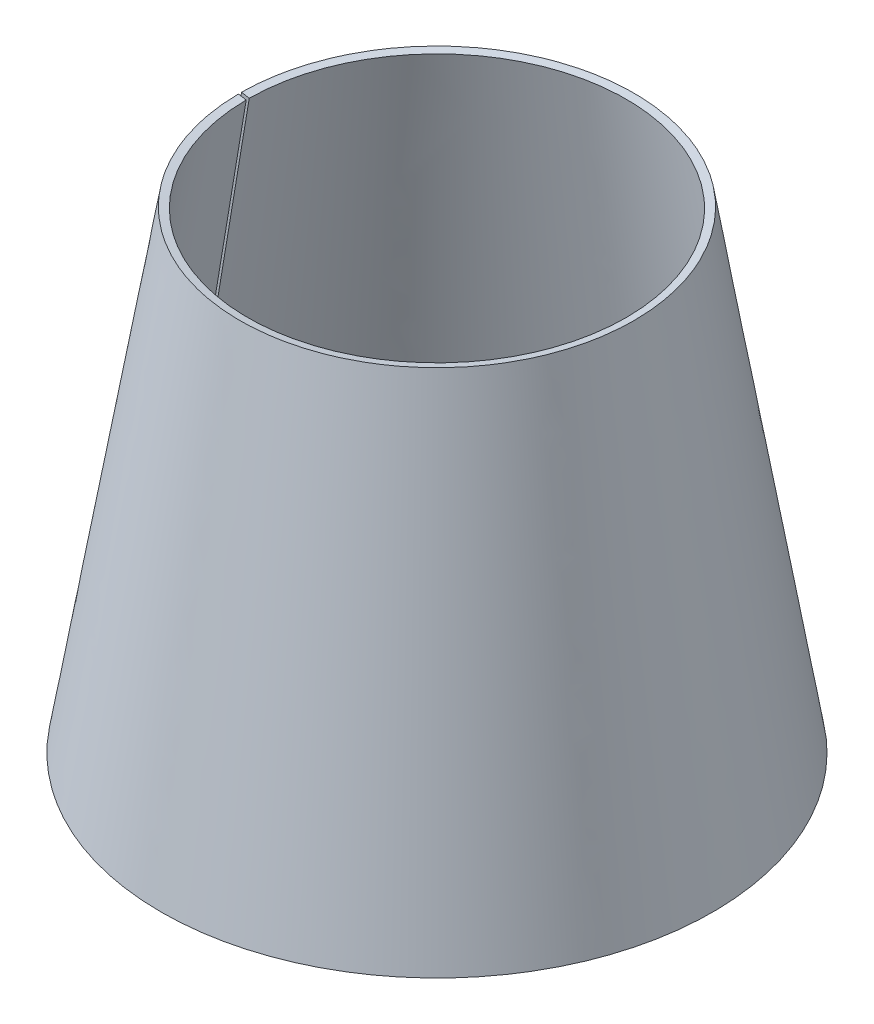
ISO-10303-21;
HEADER;
FILE_DESCRIPTION(('STEP AP214'),'2;1');
FILE_NAME('part.step','',(''),(''),'','','');
FILE_SCHEMA(('AUTOMOTIVE_DESIGN { 1 0 10303 214 1 1 1 1 }'));
ENDSEC;
DATA;
#1=APPLICATION_CONTEXT('core data for automotive mechanical design processes');
#2=APPLICATION_PROTOCOL_DEFINITION('international standard','automotive_design',2000,#1);
#3=PRODUCT_CONTEXT('',#1,'mechanical');
#4=PRODUCT('Part','Part','',(#3));
#5=PRODUCT_RELATED_PRODUCT_CATEGORY('part','',(#4));
#6=PRODUCT_DEFINITION_FORMATION('','',#4);
#7=PRODUCT_DEFINITION_CONTEXT('part definition',#1,'design');
#8=PRODUCT_DEFINITION('design','',#6,#7);
#9=PRODUCT_DEFINITION_SHAPE('','',#8);
#10=(LENGTH_UNIT() NAMED_UNIT(*) SI_UNIT(.MILLI.,.METRE.));
#11=(NAMED_UNIT(*) PLANE_ANGLE_UNIT() SI_UNIT($,.RADIAN.));
#12=(NAMED_UNIT(*) SI_UNIT($,.STERADIAN.) SOLID_ANGLE_UNIT());
#13=UNCERTAINTY_MEASURE_WITH_UNIT(LENGTH_MEASURE(1.E-05),#10,'distance_accuracy_value','');
#14=(GEOMETRIC_REPRESENTATION_CONTEXT(3) GLOBAL_UNCERTAINTY_ASSIGNED_CONTEXT((#13)) GLOBAL_UNIT_ASSIGNED_CONTEXT((#10,
#11,#12)) REPRESENTATION_CONTEXT('',''));
#15=CARTESIAN_POINT('',(0.,0.,0.));
#16=DIRECTION('',(0.,0.,1.));
#17=DIRECTION('',(1.,0.,0.));
#18=AXIS2_PLACEMENT_3D('',#15,#16,#17);
#19=CARTESIAN_POINT('',(-120.064186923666,299.178012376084,-0.9605442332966));
#20=CARTESIAN_POINT('',(-120.001486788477,299.178013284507,-8.79779140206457));
#21=CARTESIAN_POINT('',(-119.168774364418,299.178008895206,-16.631749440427));
#22=CARTESIAN_POINT('',(-115.995732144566,299.178010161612,-31.9817188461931));
#23=CARTESIAN_POINT('',(-113.654125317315,299.178008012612,-39.5038931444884));
#24=CARTESIAN_POINT('',(-107.554386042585,299.178010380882,-53.9431286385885));
#25=CARTESIAN_POINT('',(-103.793879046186,299.178007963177,-60.8658177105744));
#26=CARTESIAN_POINT('',(-95.0009995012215,299.17800946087,-73.8419427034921));
#27=CARTESIAN_POINT('',(-89.9651491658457,299.178006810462,-79.9005109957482));
#28=CARTESIAN_POINT('',(-78.8151459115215,299.17800808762,-90.9174845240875));
#29=CARTESIAN_POINT('',(-72.6966032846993,299.178005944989,-95.8802294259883));
#30=CARTESIAN_POINT('',(-59.6158849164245,299.178007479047,-104.516799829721));
#31=CARTESIAN_POINT('',(-52.648562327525,299.178005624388,-108.19402432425));
#32=CARTESIAN_POINT('',(-38.1372501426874,299.178006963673,-114.119977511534));
#33=CARTESIAN_POINT('',(-30.5875370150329,299.178005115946,-116.371044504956));
#34=CARTESIAN_POINT('',(-15.200436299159,299.1780062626,-119.359806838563));
#35=CARTESIAN_POINT('',(-7.35699296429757,299.178004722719,-120.098679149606));
#36=CARTESIAN_POINT('',(8.31754824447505,299.178005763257,-120.035979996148));
#37=CARTESIAN_POINT('',(16.154826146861,299.178004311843,-119.234384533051));
#38=CARTESIAN_POINT('',(31.517525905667,299.178005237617,-116.122620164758));
#39=CARTESIAN_POINT('',(39.0489938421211,299.178004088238,-113.811227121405));
#40=CARTESIAN_POINT('',(53.5124296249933,299.178004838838,-107.769373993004));
#41=CARTESIAN_POINT('',(60.4501038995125,299.178003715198,-104.036530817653));
#42=CARTESIAN_POINT('',(73.4613220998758,299.178004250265,-95.2955867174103));
#43=CARTESIAN_POINT('',(79.5399824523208,299.178003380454,-90.284048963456));
#44=CARTESIAN_POINT('',(90.6014699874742,299.17800418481,-79.178238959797));
#45=CARTESIAN_POINT('',(95.5886619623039,299.178003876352,-73.0795848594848));
#46=CARTESIAN_POINT('',(104.277491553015,299.178004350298,-60.0335039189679));
#47=CARTESIAN_POINT('',(107.982549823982,299.178003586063,-53.0809416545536));
#48=CARTESIAN_POINT('',(113.966508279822,299.178003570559,-38.5934344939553));
#49=CARTESIAN_POINT('',(116.247766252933,299.178003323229,-31.0527815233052));
#50=CARTESIAN_POINT('',(119.29805306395,299.178003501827,-15.6777629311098));
#51=CARTESIAN_POINT('',(120.068284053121,299.178003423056,-7.83733853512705));
#52=CARTESIAN_POINT('',(120.06828405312,299.178003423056,7.83733853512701));
#53=CARTESIAN_POINT('',(119.29805306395,299.178003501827,15.6777629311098));
#54=CARTESIAN_POINT('',(116.247766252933,299.178003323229,31.0527815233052));
#55=CARTESIAN_POINT('',(113.966508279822,299.178003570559,38.5934344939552));
#56=CARTESIAN_POINT('',(107.982549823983,299.178003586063,53.0809416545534));
#57=CARTESIAN_POINT('',(104.277491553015,299.178004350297,60.0335039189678));
#58=CARTESIAN_POINT('',(95.5886619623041,299.178003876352,73.0795848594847));
#59=CARTESIAN_POINT('',(90.6014699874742,299.17800418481,79.1782389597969));
#60=CARTESIAN_POINT('',(79.5399824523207,299.178003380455,90.284048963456));
#61=CARTESIAN_POINT('',(73.4613220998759,299.178004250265,95.2955867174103));
#62=CARTESIAN_POINT('',(60.4501038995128,299.178003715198,104.036530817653));
#63=CARTESIAN_POINT('',(53.5124296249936,299.178004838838,107.769373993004));
#64=CARTESIAN_POINT('',(39.0489938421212,299.178004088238,113.811227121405));
#65=CARTESIAN_POINT('',(31.5175259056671,299.178005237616,116.122620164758));
#66=CARTESIAN_POINT('',(16.1548261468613,299.178004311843,119.234384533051));
#67=CARTESIAN_POINT('',(8.3175482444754,299.178005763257,120.035979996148));
#68=CARTESIAN_POINT('',(-7.35699296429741,299.178004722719,120.098679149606));
#69=CARTESIAN_POINT('',(-15.200436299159,299.1780062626,119.359806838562));
#70=CARTESIAN_POINT('',(-30.5875370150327,299.178005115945,116.371044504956));
#71=CARTESIAN_POINT('',(-38.1372501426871,299.178006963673,114.119977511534));
#72=CARTESIAN_POINT('',(-52.6485623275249,299.178005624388,108.19402432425));
#73=CARTESIAN_POINT('',(-59.6158849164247,299.178007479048,104.516799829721));
#74=CARTESIAN_POINT('',(-72.6966032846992,299.178005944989,95.8802294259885));
#75=CARTESIAN_POINT('',(-78.8151459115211,299.17800808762,90.9174845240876));
#76=CARTESIAN_POINT('',(-89.9651491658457,299.178006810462,79.900510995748));
#77=CARTESIAN_POINT('',(-95.0009995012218,299.17800946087,73.8419427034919));
#78=CARTESIAN_POINT('',(-103.793879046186,299.178007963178,60.8658177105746));
#79=CARTESIAN_POINT('',(-107.554386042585,299.178010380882,53.9431286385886));
#80=CARTESIAN_POINT('',(-113.654125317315,299.178008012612,39.5038931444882));
#81=CARTESIAN_POINT('',(-115.995732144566,299.178010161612,31.9817188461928));
#82=CARTESIAN_POINT('',(-119.168774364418,299.178008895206,16.631749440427));
#83=CARTESIAN_POINT('',(-120.001486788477,299.178013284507,8.79779140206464));
#84=CARTESIAN_POINT('',(-120.064186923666,299.178012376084,0.960544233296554));
#85=CARTESIAN_POINT('',(-124.995999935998,300.,-1.00000000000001));
#86=CARTESIAN_POINT('',(-124.930716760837,300.,-9.16013575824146));
#87=CARTESIAN_POINT('',(-124.064034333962,300.,-17.3137594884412));
#88=CARTESIAN_POINT('',(-120.760190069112,300.,-33.2965004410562));
#89=CARTESIAN_POINT('',(-118.323028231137,300.,-41.1256176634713));
#90=CARTESIAN_POINT('',(-111.971918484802,300.,-56.1598956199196));
#91=CARTESIAN_POINT('',(-108.057970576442,300.,-63.3650563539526));
#92=CARTESIAN_POINT('',(-98.9026885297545,300.,-76.8759986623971));
#93=CARTESIAN_POINT('',(-93.661354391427,300.,-83.1817802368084));
#94=CARTESIAN_POINT('',(-82.0518169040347,300.,-94.6528056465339));
#95=CARTESIAN_POINT('',(-75.6836135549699,300.,-99.8180494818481));
#96=CARTESIAN_POINT('',(-62.0637939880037,300.,-108.810562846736));
#97=CARTESIAN_POINT('',(-54.8121777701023,300.,-112.637832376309));
#98=CARTESIAN_POINT('',(-39.7027892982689,300.,-118.808020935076));
#99=CARTESIAN_POINT('',(-31.845017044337,300.,-121.150939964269));
#100=CARTESIAN_POINT('',(-15.823758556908,300.,-124.262880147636));
#101=CARTESIAN_POINT('',(-7.66027232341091,300.,-125.031901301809));
#102=CARTESIAN_POINT('',(8.66028355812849,300.,-124.966618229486));
#103=CARTESIAN_POINT('',(16.8173532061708,300.,-124.13231400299));
#104=CARTESIAN_POINT('',(32.8132047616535,300.,-120.8923028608));
#105=CARTESIAN_POINT('',(40.6519866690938,300.,-118.486595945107));
#106=CARTESIAN_POINT('',(55.7115269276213,300.,-112.195730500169));
#107=CARTESIAN_POINT('',(62.9322852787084,300.,-108.310571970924));
#108=CARTESIAN_POINT('',(76.4797367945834,300.,-99.2093861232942));
#109=CARTESIAN_POINT('',(82.8064299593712,300.,-93.9933588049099));
#110=CARTESIAN_POINT('',(94.3238123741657,300.,-82.4298273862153));
#111=CARTESIAN_POINT('',(99.5145016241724,300.,-76.082323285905));
#112=CARTESIAN_POINT('',(108.56142981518,300.,-62.4985655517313));
#113=CARTESIAN_POINT('',(112.417668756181,300.,-55.2623119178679));
#114=CARTESIAN_POINT('',(118.648250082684,300.,-40.1777166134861));
#115=CARTESIAN_POINT('',(121.022592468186,300.,-32.3293749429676));
#116=CARTESIAN_POINT('',(124.198594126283,300.,-16.3206888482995));
#117=CARTESIAN_POINT('',(125.000253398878,300.,-8.16034442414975));
#118=CARTESIAN_POINT('',(125.000253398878,300.,8.16034442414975));
#119=CARTESIAN_POINT('',(124.198594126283,300.,16.3206888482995));
#120=CARTESIAN_POINT('',(121.022592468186,300.,32.3293749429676));
#121=CARTESIAN_POINT('',(118.648250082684,300.,40.1777166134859));
#122=CARTESIAN_POINT('',(112.417668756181,300.,55.2623119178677));
#123=CARTESIAN_POINT('',(108.56142981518,300.,62.4985655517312));
#124=CARTESIAN_POINT('',(99.5145016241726,300.,76.0823232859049));
#125=CARTESIAN_POINT('',(94.3238123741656,300.,82.4298273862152));
#126=CARTESIAN_POINT('',(82.8064299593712,300.,93.9933588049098));
#127=CARTESIAN_POINT('',(76.4797367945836,300.,99.2093861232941));
#128=CARTESIAN_POINT('',(62.9322852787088,300.,108.310571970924));
#129=CARTESIAN_POINT('',(55.7115269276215,300.,112.195730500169));
#130=CARTESIAN_POINT('',(40.6519866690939,300.,118.486595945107));
#131=CARTESIAN_POINT('',(32.8132047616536,300.,120.892302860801));
#132=CARTESIAN_POINT('',(16.817353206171,300.,124.13231400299));
#133=CARTESIAN_POINT('',(8.66028355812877,300.,124.966618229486));
#134=CARTESIAN_POINT('',(-7.66027232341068,300.,125.031901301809));
#135=CARTESIAN_POINT('',(-15.8237585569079,300.,124.262880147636));
#136=CARTESIAN_POINT('',(-31.8450170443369,300.,121.150939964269));
#137=CARTESIAN_POINT('',(-39.7027892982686,300.,118.808020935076));
#138=CARTESIAN_POINT('',(-54.8121777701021,300.,112.637832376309));
#139=CARTESIAN_POINT('',(-62.0637939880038,300.,108.810562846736));
#140=CARTESIAN_POINT('',(-75.68361355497,300.,99.8180494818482));
#141=CARTESIAN_POINT('',(-82.0518169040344,300.,94.6528056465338));
#142=CARTESIAN_POINT('',(-93.6613543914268,300.,83.1817802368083));
#143=CARTESIAN_POINT('',(-98.9026885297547,300.,76.8759986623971));
#144=CARTESIAN_POINT('',(-108.057970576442,300.,63.3650563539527));
#145=CARTESIAN_POINT('',(-111.971918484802,300.,56.1598956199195));
#146=CARTESIAN_POINT('',(-118.323028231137,300.,41.1256176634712));
#147=CARTESIAN_POINT('',(-120.760190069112,300.,33.296500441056));
#148=CARTESIAN_POINT('',(-124.064034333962,300.,17.3137594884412));
#149=CARTESIAN_POINT('',(-124.930716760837,300.,9.16013575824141));
#150=CARTESIAN_POINT('',(-124.995999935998,300.,0.999999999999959));
#151=B_SPLINE_SURFACE_WITH_KNOTS('',1,3,((#19,#20,#21,#22,#23,#24,#25,#26,#27,#28,#29,#30,#31,
#32,#33,#34,#35,#36,#37,#38,#39,#40,#41,#42,#43,#44,#45,#46,#47,#48,#49,#50,#51,#52,#53,#54,#55,
#56,#57,#58,#59,#60,#61,#62,#63,#64,#65,#66,#67,#68,#69,#70,#71,#72,#73,#74,#75,#76,#77,#78,#79,
#80,#81,#82,#83,#84),(#85,#86,#87,#88,#89,#90,#91,#92,#93,#94,#95,#96,#97,#98,#99,#100,#101,
#102,#103,#104,#105,#106,#107,#108,#109,#110,#111,#112,#113,#114,#115,#116,#117,#118,#119,#120,
#121,#122,#123,#124,#125,#126,#127,#128,#129,#130,#131,#132,#133,#134,#135,#136,#137,#138,#139,
#140,#141,#142,#143,#144,#145,#146,#147,#148,#149,#150)),.UNSPECIFIED.,.F.,.F.,.F.,(2,2),(4,2,2,
2,2,2,2,2,2,2,2,2,2,2,2,2,2,2,2,2,2,2,2,2,2,2,2,2,2,2,2,2,4),(0.,1.),(0.,0.03125,0.0625,0.09375,
0.125,0.15625,0.1875,0.21875,0.25,0.28125,0.3125,0.34375,0.375,0.40625,0.4375,0.46875,0.5,
0.53125,0.5625,0.59375,0.625,0.65625,0.6875,0.71875,0.75,0.78125,0.8125,0.84375,0.875,0.90625,
0.9375,0.96875,1.),.UNSPECIFIED.);
#152=CARTESIAN_POINT('',(-124.995999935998,300.,0.999999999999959));
#153=CARTESIAN_POINT('',(-120.064186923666,299.178012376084,0.960544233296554));
#154=B_SPLINE_CURVE_WITH_KNOTS('',1,(#152,#153),.UNSPECIFIED.,.F.,.F.,(2,2),(0.,1.),.UNSPECIFIED.);
#155=CARTESIAN_POINT('',(-124.995999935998,300.,0.999999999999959));
#156=VERTEX_POINT('',#155);
#157=CARTESIAN_POINT('',(-120.064186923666,299.178012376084,0.960544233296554));
#158=VERTEX_POINT('',#157);
#159=EDGE_CURVE('E14',#156,#158,#154,.T.);
#160=CARTESIAN_POINT('',(-124.995999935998,300.,0.999999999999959));
#161=CARTESIAN_POINT('',(-124.930716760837,300.,9.16013575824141));
#162=CARTESIAN_POINT('',(-124.064034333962,300.,17.3137594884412));
#163=CARTESIAN_POINT('',(-120.760190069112,300.,33.296500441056));
#164=CARTESIAN_POINT('',(-118.323028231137,300.,41.1256176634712));
#165=CARTESIAN_POINT('',(-111.971918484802,300.,56.1598956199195));
#166=CARTESIAN_POINT('',(-108.057970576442,300.,63.3650563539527));
#167=CARTESIAN_POINT('',(-98.9026885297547,300.,76.8759986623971));
#168=CARTESIAN_POINT('',(-93.6613543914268,300.,83.1817802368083));
#169=CARTESIAN_POINT('',(-82.0518169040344,300.,94.6528056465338));
#170=CARTESIAN_POINT('',(-75.68361355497,300.,99.8180494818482));
#171=CARTESIAN_POINT('',(-62.0637939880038,300.,108.810562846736));
#172=CARTESIAN_POINT('',(-54.8121777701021,300.,112.637832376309));
#173=CARTESIAN_POINT('',(-39.7027892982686,300.,118.808020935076));
#174=CARTESIAN_POINT('',(-31.8450170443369,300.,121.150939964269));
#175=CARTESIAN_POINT('',(-15.8237585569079,300.,124.262880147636));
#176=CARTESIAN_POINT('',(-7.66027232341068,300.,125.031901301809));
#177=CARTESIAN_POINT('',(8.66028355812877,300.,124.966618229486));
#178=CARTESIAN_POINT('',(16.817353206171,300.,124.13231400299));
#179=CARTESIAN_POINT('',(32.8132047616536,300.,120.892302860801));
#180=CARTESIAN_POINT('',(40.6519866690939,300.,118.486595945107));
#181=CARTESIAN_POINT('',(55.7115269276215,300.,112.195730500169));
#182=CARTESIAN_POINT('',(62.9322852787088,300.,108.310571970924));
#183=CARTESIAN_POINT('',(76.4797367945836,300.,99.2093861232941));
#184=CARTESIAN_POINT('',(82.8064299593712,300.,93.9933588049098));
#185=CARTESIAN_POINT('',(94.3238123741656,300.,82.4298273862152));
#186=CARTESIAN_POINT('',(99.5145016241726,300.,76.0823232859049));
#187=CARTESIAN_POINT('',(108.56142981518,300.,62.4985655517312));
#188=CARTESIAN_POINT('',(112.417668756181,300.,55.2623119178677));
#189=CARTESIAN_POINT('',(118.648250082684,300.,40.1777166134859));
#190=CARTESIAN_POINT('',(121.022592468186,300.,32.3293749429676));
#191=CARTESIAN_POINT('',(124.198594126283,300.,16.3206888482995));
#192=CARTESIAN_POINT('',(125.000253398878,300.,8.16034442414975));
#193=CARTESIAN_POINT('',(125.000253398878,300.,-8.16034442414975));
#194=CARTESIAN_POINT('',(124.198594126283,300.,-16.3206888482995));
#195=CARTESIAN_POINT('',(121.022592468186,300.,-32.3293749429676));
#196=CARTESIAN_POINT('',(118.648250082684,300.,-40.1777166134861));
#197=CARTESIAN_POINT('',(112.417668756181,300.,-55.2623119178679));
#198=CARTESIAN_POINT('',(108.56142981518,300.,-62.4985655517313));
#199=CARTESIAN_POINT('',(99.5145016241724,300.,-76.082323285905));
#200=CARTESIAN_POINT('',(94.3238123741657,300.,-82.4298273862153));
#201=CARTESIAN_POINT('',(82.8064299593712,300.,-93.9933588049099));
#202=CARTESIAN_POINT('',(76.4797367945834,300.,-99.2093861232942));
#203=CARTESIAN_POINT('',(62.9322852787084,300.,-108.310571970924));
#204=CARTESIAN_POINT('',(55.7115269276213,300.,-112.195730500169));
#205=CARTESIAN_POINT('',(40.6519866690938,300.,-118.486595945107));
#206=CARTESIAN_POINT('',(32.8132047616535,300.,-120.8923028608));
#207=CARTESIAN_POINT('',(16.8173532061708,300.,-124.13231400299));
#208=CARTESIAN_POINT('',(8.66028355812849,300.,-124.966618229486));
#209=CARTESIAN_POINT('',(-7.66027232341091,300.,-125.031901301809));
#210=CARTESIAN_POINT('',(-15.823758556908,300.,-124.262880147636));
#211=CARTESIAN_POINT('',(-31.845017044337,300.,-121.150939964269));
#212=CARTESIAN_POINT('',(-39.7027892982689,300.,-118.808020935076));
#213=CARTESIAN_POINT('',(-54.8121777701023,300.,-112.637832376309));
#214=CARTESIAN_POINT('',(-62.0637939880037,300.,-108.810562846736));
#215=CARTESIAN_POINT('',(-75.6836135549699,300.,-99.8180494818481));
#216=CARTESIAN_POINT('',(-82.0518169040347,300.,-94.6528056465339));
#217=CARTESIAN_POINT('',(-93.661354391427,300.,-83.1817802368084));
#218=CARTESIAN_POINT('',(-98.9026885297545,300.,-76.8759986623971));
#219=CARTESIAN_POINT('',(-108.057970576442,300.,-63.3650563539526));
#220=CARTESIAN_POINT('',(-111.971918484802,300.,-56.1598956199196));
#221=CARTESIAN_POINT('',(-118.323028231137,300.,-41.1256176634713));
#222=CARTESIAN_POINT('',(-120.760190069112,300.,-33.2965004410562));
#223=CARTESIAN_POINT('',(-124.064034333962,300.,-17.3137594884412));
#224=CARTESIAN_POINT('',(-124.930716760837,300.,-9.16013575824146));
#225=CARTESIAN_POINT('',(-124.995999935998,300.,-1.00000000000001));
#226=B_SPLINE_CURVE_WITH_KNOTS('',3,(#160,#161,#162,#163,#164,#165,#166,#167,#168,#169,#170,
#171,#172,#173,#174,#175,#176,#177,#178,#179,#180,#181,#182,#183,#184,#185,#186,#187,#188,#189,
#190,#191,#192,#193,#194,#195,#196,#197,#198,#199,#200,#201,#202,#203,#204,#205,#206,#207,#208,
#209,#210,#211,#212,#213,#214,#215,#216,#217,#218,#219,#220,#221,#222,#223,#224,#225),
.UNSPECIFIED.,.F.,.F.,(4,2,2,2,2,2,2,2,2,2,2,2,2,2,2,2,2,2,2,2,2,2,2,2,2,2,2,2,2,2,2,2,4),(0.,
0.03125,0.0625,0.09375,0.125,0.15625,0.1875,0.21875,0.25,0.28125,0.3125,0.34375,0.375,0.40625,
0.4375,0.46875,0.5,0.53125,0.5625,0.59375,0.625,0.65625,0.6875,0.71875,0.75,0.78125,0.8125,
0.84375,0.875,0.90625,0.9375,0.96875,1.),.UNSPECIFIED.);
#227=CARTESIAN_POINT('',(-124.995999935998,300.,-1.00000000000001));
#228=VERTEX_POINT('',#227);
#229=EDGE_CURVE('E122',#156,#228,#226,.T.);
#230=CARTESIAN_POINT('',(-124.995999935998,300.,-1.00000000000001));
#231=CARTESIAN_POINT('',(-120.064186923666,299.178012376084,-0.9605442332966));
#232=B_SPLINE_CURVE_WITH_KNOTS('',1,(#230,#231),.UNSPECIFIED.,.F.,.F.,(2,2),(0.,1.),.UNSPECIFIED.);
#233=CARTESIAN_POINT('',(-120.064186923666,299.178012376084,-0.9605442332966));
#234=VERTEX_POINT('',#233);
#235=EDGE_CURVE('E71',#228,#234,#232,.T.);
#236=CARTESIAN_POINT('',(-120.064186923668,299.178012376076,0.960544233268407));
#237=CARTESIAN_POINT('',(-120.048508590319,299.178012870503,2.92001478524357));
#238=CARTESIAN_POINT('',(-119.984720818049,299.178013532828,4.8790866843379));
#239=CARTESIAN_POINT('',(-119.761406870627,299.178014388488,8.79195741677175));
#240=CARTESIAN_POINT('',(-119.601871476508,299.178014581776,10.7457557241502));
#241=CARTESIAN_POINT('',(-119.187547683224,299.178013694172,14.6432081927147));
#242=CARTESIAN_POINT('',(-118.932760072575,299.178012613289,16.5868624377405));
#243=CARTESIAN_POINT('',(-118.328439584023,299.178010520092,20.4591696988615));
#244=CARTESIAN_POINT('',(-117.978917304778,299.178009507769,22.3878243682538));
#245=CARTESIAN_POINT('',(-117.185588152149,299.178009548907,26.2256490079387));
#246=CARTESIAN_POINT('',(-116.741781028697,299.178010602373,28.1348189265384));
#247=CARTESIAN_POINT('',(-115.761255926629,299.178012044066,31.9293737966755));
#248=CARTESIAN_POINT('',(-115.22452740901,299.178012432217,33.8147560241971));
#249=CARTESIAN_POINT('',(-114.059598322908,299.178012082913,37.5570560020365));
#250=CARTESIAN_POINT('',(-113.43139732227,299.178011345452,39.4139736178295));
#251=CARTESIAN_POINT('',(-112.084987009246,299.178009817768,43.0946713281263));
#252=CARTESIAN_POINT('',(-111.366787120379,299.178009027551,44.9184548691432));
#253=CARTESIAN_POINT('',(-109.841725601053,299.178009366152,48.5285636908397));
#254=CARTESIAN_POINT('',(-109.034864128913,299.178010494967,50.3148890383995));
#255=CARTESIAN_POINT('',(-107.334657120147,299.178012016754,53.8461185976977));
#256=CARTESIAN_POINT('',(-106.441302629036,299.178012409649,55.5910184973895));
#257=CARTESIAN_POINT('',(-104.570420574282,299.178012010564,59.0350893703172));
#258=CARTESIAN_POINT('',(-103.592893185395,299.178011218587,60.7342604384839));
#259=CARTESIAN_POINT('',(-101.555999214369,299.178009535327,64.082577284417));
#260=CARTESIAN_POINT('',(-100.496641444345,299.178008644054,65.7317284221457));
#261=CARTESIAN_POINT('',(-98.2982353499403,299.178008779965,68.9760345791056));
#262=CARTESIAN_POINT('',(-97.1591868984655,299.178009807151,70.5711895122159));
#263=CARTESIAN_POINT('',(-94.804308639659,299.178011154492,73.7040447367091));
#264=CARTESIAN_POINT('',(-93.588470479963,299.178011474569,75.2417387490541));
#265=CARTESIAN_POINT('',(-91.0831234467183,299.178010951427,78.2558944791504));
#266=CARTESIAN_POINT('',(-89.7936145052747,299.178010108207,79.732356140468));
#267=CARTESIAN_POINT('',(-87.1440569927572,299.178008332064,82.6202851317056));
#268=CARTESIAN_POINT('',(-85.7840159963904,299.178007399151,84.0317594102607));
#269=CARTESIAN_POINT('',(-82.9962805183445,299.178007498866,86.7862346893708));
#270=CARTESIAN_POINT('',(-81.5685861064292,299.178008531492,88.1292357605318));
#271=CARTESIAN_POINT('',(-78.6490698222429,299.178009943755,90.743937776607));
#272=CARTESIAN_POINT('',(-77.1572411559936,299.178010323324,92.0156311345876));
#273=CARTESIAN_POINT('',(-74.1132401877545,299.178009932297,94.484619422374));
#274=CARTESIAN_POINT('',(-72.5610679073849,299.178009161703,95.6819143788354));
#275=CARTESIAN_POINT('',(-69.4001804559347,299.178007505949,97.9990268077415));
#276=CARTESIAN_POINT('',(-67.7914713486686,299.178006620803,99.1188525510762));
#277=CARTESIAN_POINT('',(-64.5210164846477,299.178006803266,101.278176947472));
#278=CARTESIAN_POINT('',(-62.8592707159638,299.178007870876,102.317675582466));
#279=CARTESIAN_POINT('',(-59.4867515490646,299.178009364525,104.314257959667));
#280=CARTESIAN_POINT('',(-57.7759729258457,299.178009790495,105.271332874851));
#281=CARTESIAN_POINT('',(-54.3097031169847,299.178009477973,107.100763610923));
#282=CARTESIAN_POINT('',(-52.5542119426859,299.178008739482,107.973119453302));
#283=CARTESIAN_POINT('',(-49.0028449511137,299.178007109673,109.63083006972));
#284=CARTESIAN_POINT('',(-47.2069734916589,299.178006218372,110.416194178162));
#285=CARTESIAN_POINT('',(-43.578839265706,299.178006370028,111.897807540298));
#286=CARTESIAN_POINT('',(-41.74657650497,299.178007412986,112.594056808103));
#287=CARTESIAN_POINT('',(-38.0499977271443,299.17800887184,113.896174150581));
#288=CARTESIAN_POINT('',(-36.185678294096,299.178009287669,114.502032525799));
#289=CARTESIAN_POINT('',(-32.4296670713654,299.178008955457,115.621948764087));
#290=CARTESIAN_POINT('',(-30.537975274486,299.178008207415,116.136006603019));
#291=CARTESIAN_POINT('',(-26.7319085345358,299.178006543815,117.07092672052));
#292=CARTESIAN_POINT('',(-24.8175360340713,299.178005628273,117.491798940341));
#293=CARTESIAN_POINT('',(-20.9704370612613,299.178005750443,118.239052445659));
#294=CARTESIAN_POINT('',(-19.0377105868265,299.178006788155,118.565433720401));
#295=CARTESIAN_POINT('',(-15.1584060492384,299.178008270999,119.123306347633));
#296=CARTESIAN_POINT('',(-13.2118265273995,299.178008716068,119.354787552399));
#297=CARTESIAN_POINT('',(-9.3096836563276,299.178008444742,119.722377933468));
#298=CARTESIAN_POINT('',(-7.35412030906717,299.178007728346,119.858487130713));
#299=CARTESIAN_POINT('',(-3.43888094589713,299.178006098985,120.034876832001));
#300=CARTESIAN_POINT('',(-1.47920539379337,299.178005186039,120.075167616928));
#301=CARTESIAN_POINT('',(2.43976049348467,299.178005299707,120.059491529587));
#302=CARTESIAN_POINT('',(4.39905082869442,299.178006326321,120.003524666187));
#303=CARTESIAN_POINT('',(8.31275323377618,299.178007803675,119.795818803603));
#304=CARTESIAN_POINT('',(10.2671647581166,299.178008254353,119.644069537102));
#305=CARTESIAN_POINT('',(14.1662413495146,299.178007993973,119.245273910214));
#306=CARTESIAN_POINT('',(16.1109064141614,299.178007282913,118.998227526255));
#307=CARTESIAN_POINT('',(19.9856234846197,299.178005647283,118.409338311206));
#308=CARTESIAN_POINT('',(21.9156770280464,299.178004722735,118.067505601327));
#309=CARTESIAN_POINT('',(25.7566752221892,299.178004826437,117.289499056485));
#310=CARTESIAN_POINT('',(27.6676198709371,299.178005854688,116.853325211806));
#311=CARTESIAN_POINT('',(31.4660864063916,299.178007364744,115.887986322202));
#312=CARTESIAN_POINT('',(33.3536057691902,299.17800784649,115.358811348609));
#313=CARTESIAN_POINT('',(37.1005384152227,299.178007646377,114.208882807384));
#314=CARTESIAN_POINT('',(38.9599517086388,299.178006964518,113.588129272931));
#315=CARTESIAN_POINT('',(42.6459954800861,299.178005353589,112.256481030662));
#316=CARTESIAN_POINT('',(44.4726294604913,299.178004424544,111.545596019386));
#317=CARTESIAN_POINT('',(48.0887937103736,299.178004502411,110.035005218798));
#318=CARTESIAN_POINT('',(49.8783239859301,299.178005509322,109.23529944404));
#319=CARTESIAN_POINT('',(53.4163139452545,299.178006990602,107.549231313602));
#320=CARTESIAN_POINT('',(55.1647691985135,299.178007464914,106.662859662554));
#321=CARTESIAN_POINT('',(58.616291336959,299.178007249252,104.805757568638));
#322=CARTESIAN_POINT('',(60.3193581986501,299.178006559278,103.835027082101));
#323=CARTESIAN_POINT('',(63.6757970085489,299.17800491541,101.811528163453));
#324=CARTESIAN_POINT('',(65.3291742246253,299.178003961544,100.758768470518));
#325=CARTESIAN_POINT('',(68.5822523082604,299.178004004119,98.5733487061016));
#326=CARTESIAN_POINT('',(70.1819531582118,299.17800500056,97.4406886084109));
#327=CARTESIAN_POINT('',(73.324206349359,299.178006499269,95.0983623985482));
#328=CARTESIAN_POINT('',(74.866752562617,299.178007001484,93.8886880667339));
#329=CARTESIAN_POINT('',(77.8909070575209,299.178006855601,91.3954265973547));
#330=CARTESIAN_POINT('',(79.3725153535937,299.178006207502,90.1118394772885));
#331=CARTESIAN_POINT('',(82.271020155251,299.178004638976,87.4738660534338));
#332=CARTESIAN_POINT('',(83.687923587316,299.178003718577,86.1194873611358));
#333=CARTESIAN_POINT('',(86.4535289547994,299.178003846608,83.3428004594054));
#334=CARTESIAN_POINT('',(87.8022308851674,299.178004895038,81.920492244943));
#335=CARTESIAN_POINT('',(90.428592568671,299.178006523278,79.0114611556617));
#336=CARTESIAN_POINT('',(91.7062446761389,299.178007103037,77.5247313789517));
#337=CARTESIAN_POINT('',(94.1873925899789,299.178007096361,74.4906295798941));
#338=CARTESIAN_POINT('',(95.3908883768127,299.178006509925,72.9432575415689));
#339=CARTESIAN_POINT('',(97.7206287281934,299.178005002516,69.7916606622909));
#340=CARTESIAN_POINT('',(98.8468815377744,299.178004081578,68.1874419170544));
#341=CARTESIAN_POINT('',(101.019271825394,299.178004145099,64.9256470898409));
#342=CARTESIAN_POINT('',(102.065409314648,299.178005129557,63.2680710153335));
#343=CARTESIAN_POINT('',(104.075465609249,299.178006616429,59.903562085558));
#344=CARTESIAN_POINT('',(105.039375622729,299.178007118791,58.1966239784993));
#345=CARTESIAN_POINT('',(106.882656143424,299.178006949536,54.737696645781));
#346=CARTESIAN_POINT('',(107.762026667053,299.178006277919,52.9857074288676));
#347=CARTESIAN_POINT('',(109.43392954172,299.178004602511,49.4409964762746));
#348=CARTESIAN_POINT('',(110.226471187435,299.178003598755,47.648279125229));
#349=CARTESIAN_POINT('',(111.722586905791,299.178003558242,44.0260970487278));
#350=CARTESIAN_POINT('',(112.426160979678,299.178004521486,42.196632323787));
#351=CARTESIAN_POINT('',(113.743057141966,299.17800603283,38.5052888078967));
#352=CARTESIAN_POINT('',(114.356369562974,299.178006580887,36.643406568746));
#353=CARTESIAN_POINT('',(115.491303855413,299.178006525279,32.8919033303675));
#354=CARTESIAN_POINT('',(116.012925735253,299.178005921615,31.0022823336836));
#355=CARTESIAN_POINT('',(116.963064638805,299.178004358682,27.1999852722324));
#356=CARTESIAN_POINT('',(117.391591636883,299.178003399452,25.2873117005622));
#357=CARTESIAN_POINT('',(118.154227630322,299.178003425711,21.4432330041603));
#358=CARTESIAN_POINT('',(118.488336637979,299.1780044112,19.5118278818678));
#359=CARTESIAN_POINT('',(119.061720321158,299.178005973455,15.6347863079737));
#360=CARTESIAN_POINT('',(119.30098484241,299.178006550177,13.6891483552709));
#361=CARTESIAN_POINT('',(119.68417859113,299.178006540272,9.78850676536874));
#362=CARTESIAN_POINT('',(119.828107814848,299.178005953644,7.83350312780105));
#363=CARTESIAN_POINT('',(120.020155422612,299.178004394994,3.91899932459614));
#364=CARTESIAN_POINT('',(120.068284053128,299.178003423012,1.9594996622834));
#365=CARTESIAN_POINT('',(120.068284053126,299.178003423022,-1.95949966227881));
#366=CARTESIAN_POINT('',(120.02015542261,299.178004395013,-3.91899932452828));
#367=CARTESIAN_POINT('',(119.828107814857,299.178005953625,-7.83350312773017));
#368=CARTESIAN_POINT('',(119.684178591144,299.178006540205,-9.7885067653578));
#369=CARTESIAN_POINT('',(119.300984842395,299.178006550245,-13.6891483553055));
#370=CARTESIAN_POINT('',(119.061720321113,299.178005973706,-15.6347863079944));
#371=CARTESIAN_POINT('',(118.488336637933,299.178004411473,-19.5118278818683));
#372=CARTESIAN_POINT('',(118.154227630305,299.178003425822,-21.4432330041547));
#373=CARTESIAN_POINT('',(117.391591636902,299.178003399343,-25.2873117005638));
#374=CARTESIAN_POINT('',(116.963064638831,299.178004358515,-27.1999852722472));
#375=CARTESIAN_POINT('',(116.012925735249,299.178005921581,-31.0022823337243));
#376=CARTESIAN_POINT('',(115.491303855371,299.178006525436,-32.8919033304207));
#377=CARTESIAN_POINT('',(114.356369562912,299.178006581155,-36.6434065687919));
#378=CARTESIAN_POINT('',(113.743057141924,299.178006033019,-38.5052888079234));
#379=CARTESIAN_POINT('',(112.426160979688,299.178004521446,-42.1966323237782));
#380=CARTESIAN_POINT('',(111.722586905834,299.178003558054,-44.0260970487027));
#381=CARTESIAN_POINT('',(110.226471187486,299.178003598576,-47.6482791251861));
#382=CARTESIAN_POINT('',(109.433929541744,299.17800460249,-49.4409964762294));
#383=CARTESIAN_POINT('',(107.762026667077,299.178006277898,-52.9857074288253));
#384=CARTESIAN_POINT('',(106.882656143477,299.178006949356,-54.7376966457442));
#385=CARTESIAN_POINT('',(105.039375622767,299.17800711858,-58.1966239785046));
#386=CARTESIAN_POINT('',(104.075465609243,299.178006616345,-59.9035620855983));
#387=CARTESIAN_POINT('',(102.065409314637,299.1780051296,-63.2680710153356));
#388=CARTESIAN_POINT('',(101.019271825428,299.178004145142,-64.9256470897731));
#389=CARTESIAN_POINT('',(98.8468815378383,299.178004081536,-68.1874419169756));
#390=CARTESIAN_POINT('',(97.7206287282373,299.178005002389,-69.7916606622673));
#391=CARTESIAN_POINT('',(95.3908883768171,299.178006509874,-72.943257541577));
#392=CARTESIAN_POINT('',(94.1873925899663,299.17800709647,-74.4906295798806));
#393=CARTESIAN_POINT('',(91.7062446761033,299.178007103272,-77.5247313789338));
#394=CARTESIAN_POINT('',(90.4285925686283,299.178006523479,-79.0114611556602));
#395=CARTESIAN_POINT('',(87.8022308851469,299.17800489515,-81.9204922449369));
#396=CARTESIAN_POINT('',(86.4535289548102,299.178003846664,-83.34280045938));
#397=CARTESIAN_POINT('',(83.6879235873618,299.17800371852,-86.1194873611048));
#398=CARTESIAN_POINT('',(82.271020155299,299.178004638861,-87.4738660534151));
#399=CARTESIAN_POINT('',(79.372515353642,299.178006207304,-90.1118394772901));
#400=CARTESIAN_POINT('',(77.8909070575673,299.178006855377,-91.3954265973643));
#401=CARTESIAN_POINT('',(74.866752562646,299.178007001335,-93.8886880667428));
#402=CARTESIAN_POINT('',(73.3242063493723,299.17800649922,-95.0983623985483));
#403=CARTESIAN_POINT('',(70.1819531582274,299.178005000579,-97.4406886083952));
#404=CARTESIAN_POINT('',(68.5822523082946,299.178004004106,-98.5733487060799));
#405=CARTESIAN_POINT('',(65.3291742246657,299.178003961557,-100.758768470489));
#406=CARTESIAN_POINT('',(63.675797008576,299.178004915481,-101.811528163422));
#407=CARTESIAN_POINT('',(60.3193581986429,299.178006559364,-103.83502708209));
#408=CARTESIAN_POINT('',(58.6162913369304,299.178007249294,-104.805757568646));
#409=CARTESIAN_POINT('',(55.1647691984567,299.178007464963,-106.662859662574));
#410=CARTESIAN_POINT('',(53.4163139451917,299.178006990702,-107.549231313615));
#411=CARTESIAN_POINT('',(49.8783239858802,299.178005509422,-109.235299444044));
#412=CARTESIAN_POINT('',(48.0887937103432,299.178004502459,-110.035005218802));
#413=CARTESIAN_POINT('',(44.4726294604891,299.178004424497,-111.545596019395));
#414=CARTESIAN_POINT('',(42.6459954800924,299.178005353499,-112.256481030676));
#415=CARTESIAN_POINT('',(38.9599517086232,299.178006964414,-113.588129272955));
#416=CARTESIAN_POINT('',(37.100538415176,299.178007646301,-114.208882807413));
#417=CARTESIAN_POINT('',(33.3536057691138,299.178007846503,-115.358811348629));
#418=CARTESIAN_POINT('',(31.4660864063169,299.178007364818,-115.887986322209));
#419=CARTESIAN_POINT('',(27.6676198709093,299.178005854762,-116.853325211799));
#420=CARTESIAN_POINT('',(25.7566752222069,299.178004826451,-117.289499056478));
#421=CARTESIAN_POINT('',(21.9156770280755,299.17800472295,-118.067505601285));
#422=CARTESIAN_POINT('',(19.9856234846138,299.178005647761,-118.409338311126));
#423=CARTESIAN_POINT('',(16.1109064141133,299.178007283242,-118.998227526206));
#424=CARTESIAN_POINT('',(14.1662413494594,299.178007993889,-119.245273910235));
#425=CARTESIAN_POINT('',(10.2671647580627,299.178008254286,-119.644069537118));
#426=CARTESIAN_POINT('',(8.31275323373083,299.178007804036,-119.795818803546));
#427=CARTESIAN_POINT('',(4.39905082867,299.178006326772,-120.003524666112));
#428=CARTESIAN_POINT('',(2.43976049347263,299.17800529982,-120.059491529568));
#429=CARTESIAN_POINT('',(-1.47920539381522,299.178005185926,-120.075167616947));
#430=CARTESIAN_POINT('',(-3.43888094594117,299.178006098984,-120.034876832));
#431=CARTESIAN_POINT('',(-7.3541203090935,299.178007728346,-119.858487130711));
#432=CARTESIAN_POINT('',(-9.30968365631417,299.178008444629,-119.722377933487));
#433=CARTESIAN_POINT('',(-13.2118265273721,299.178008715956,-119.354787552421));
#434=CARTESIAN_POINT('',(-15.1584060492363,299.178008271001,-119.123306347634));
#435=CARTESIAN_POINT('',(-19.0377105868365,299.178006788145,-118.565433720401));
#436=CARTESIAN_POINT('',(-20.9704370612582,299.178005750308,-118.239052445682));
#437=CARTESIAN_POINT('',(-24.8175360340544,299.178005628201,-117.491798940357));
#438=CARTESIAN_POINT('',(-26.731908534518,299.17800654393,-117.070926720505));
#439=CARTESIAN_POINT('',(-30.5379752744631,299.17800820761,-116.136006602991));
#440=CARTESIAN_POINT('',(-32.4296670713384,299.178008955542,-115.62194876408));
#441=CARTESIAN_POINT('',(-36.1856782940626,299.178009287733,-114.502032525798));
#442=CARTESIAN_POINT('',(-38.0499977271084,299.178008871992,-113.896174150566));
#443=CARTESIAN_POINT('',(-41.7465765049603,299.178007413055,-112.594056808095));
#444=CARTESIAN_POINT('',(-43.5788392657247,299.178006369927,-111.897807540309));
#445=CARTESIAN_POINT('',(-47.2069734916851,299.178006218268,-110.416194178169));
#446=CARTESIAN_POINT('',(-49.0028449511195,299.178007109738,-109.630830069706));
#447=CARTESIAN_POINT('',(-52.5542119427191,299.178008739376,-107.973119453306));
#448=CARTESIAN_POINT('',(-54.3097031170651,299.178009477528,-107.100763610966));
#449=CARTESIAN_POINT('',(-57.7759729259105,299.178009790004,-105.271332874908));
#450=CARTESIAN_POINT('',(-59.486751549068,299.178009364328,-104.314257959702));
#451=CARTESIAN_POINT('',(-62.8592707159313,299.178007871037,-102.317675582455));
#452=CARTESIAN_POINT('',(-64.5210164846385,299.178006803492,-101.278176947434));
#453=CARTESIAN_POINT('',(-67.7914713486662,299.178006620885,-99.1188525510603));
#454=CARTESIAN_POINT('',(-69.400180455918,299.178007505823,-97.999026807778));
#455=CARTESIAN_POINT('',(-72.5610679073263,299.178009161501,-95.6819143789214));
#456=CARTESIAN_POINT('',(-74.1132401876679,299.178009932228,-94.4846194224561));
#457=CARTESIAN_POINT('',(-77.1572411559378,299.178010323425,-92.0156311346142));
#458=CARTESIAN_POINT('',(-78.6490698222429,299.178009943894,-90.7439377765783));
#459=CARTESIAN_POINT('',(-81.5685861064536,299.178008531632,-88.1292357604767));
#460=CARTESIAN_POINT('',(-82.9962805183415,299.178007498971,-86.786234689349));
#461=CARTESIAN_POINT('',(-85.7840159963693,299.178007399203,-84.0317594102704));
#462=CARTESIAN_POINT('',(-87.1440569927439,299.1780083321,-82.6202851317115));
#463=CARTESIAN_POINT('',(-89.793614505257,299.178010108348,-79.7323561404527));
#464=CARTESIAN_POINT('',(-91.0831234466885,299.178010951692,-78.2558944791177));
#465=CARTESIAN_POINT('',(-93.5884704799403,299.178011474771,-75.2417387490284));
#466=CARTESIAN_POINT('',(-94.8043086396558,299.178011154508,-73.704044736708));
#467=CARTESIAN_POINT('',(-97.1591868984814,299.17800980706,-70.5711895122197));
#468=CARTESIAN_POINT('',(-98.2982353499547,299.178008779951,-68.976034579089));
#469=CARTESIAN_POINT('',(-100.496641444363,299.178008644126,-65.7317284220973));
#470=CARTESIAN_POINT('',(-101.555999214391,299.178009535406,-64.0825772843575));
#471=CARTESIAN_POINT('',(-103.59289318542,299.178011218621,-60.7342604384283));
#472=CARTESIAN_POINT('',(-104.570420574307,299.178012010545,-59.0350893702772));
#473=CARTESIAN_POINT('',(-106.441302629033,299.178012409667,-55.5910184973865));
#474=CARTESIAN_POINT('',(-107.334657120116,299.178012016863,-53.8461185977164));
#475=CARTESIAN_POINT('',(-109.034864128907,299.17801049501,-50.3148890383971));
#476=CARTESIAN_POINT('',(-109.841725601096,299.178009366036,-48.5285636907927));
#477=CARTESIAN_POINT('',(-111.366787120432,299.178009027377,-44.9184548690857));
#478=CARTESIAN_POINT('',(-112.084987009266,299.178009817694,-43.0946713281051));
#479=CARTESIAN_POINT('',(-113.431397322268,299.178011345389,-39.4139736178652));
#480=CARTESIAN_POINT('',(-114.059598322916,299.178012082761,-37.5570560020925));
#481=CARTESIAN_POINT('',(-115.224527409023,299.17801243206,-33.8147560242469));
#482=CARTESIAN_POINT('',(-115.761255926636,299.178012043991,-31.9293737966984));
#483=CARTESIAN_POINT('',(-116.741781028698,299.178010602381,-28.1348189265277));
#484=CARTESIAN_POINT('',(-117.185588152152,299.178009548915,-26.2256490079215));
#485=CARTESIAN_POINT('',(-117.978917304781,299.178009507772,-22.3878243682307));
#486=CARTESIAN_POINT('',(-118.328439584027,299.178010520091,-20.4591696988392));
#487=CARTESIAN_POINT('',(-118.932760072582,299.178012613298,-16.5868624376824));
#488=CARTESIAN_POINT('',(-119.187547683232,299.178013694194,-14.6432081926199));
#489=CARTESIAN_POINT('',(-119.601871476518,299.178014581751,-10.7457557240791));
#490=CARTESIAN_POINT('',(-119.761406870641,299.178014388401,-8.79195741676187));
#491=CARTESIAN_POINT('',(-119.984720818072,299.178013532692,-4.87908668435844));
#492=CARTESIAN_POINT('',(-120.048508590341,299.178012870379,-2.92001478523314));
#493=CARTESIAN_POINT('',(-120.064186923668,299.178012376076,-0.96054423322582));
#494=B_SPLINE_CURVE_WITH_KNOTS('',3,(#236,#237,#238,#239,#240,#241,#242,#243,#244,#245,#246,
#247,#248,#249,#250,#251,#252,#253,#254,#255,#256,#257,#258,#259,#260,#261,#262,#263,#264,#265,
#266,#267,#268,#269,#270,#271,#272,#273,#274,#275,#276,#277,#278,#279,#280,#281,#282,#283,#284,
#285,#286,#287,#288,#289,#290,#291,#292,#293,#294,#295,#296,#297,#298,#299,#300,#301,#302,#303,
#304,#305,#306,#307,#308,#309,#310,#311,#312,#313,#314,#315,#316,#317,#318,#319,#320,#321,#322,
#323,#324,#325,#326,#327,#328,#329,#330,#331,#332,#333,#334,#335,#336,#337,#338,#339,#340,#341,
#342,#343,#344,#345,#346,#347,#348,#349,#350,#351,#352,#353,#354,#355,#356,#357,#358,#359,#360,
#361,#362,#363,#364,#365,#366,#367,#368,#369,#370,#371,#372,#373,#374,#375,#376,#377,#378,#379,
#380,#381,#382,#383,#384,#385,#386,#387,#388,#389,#390,#391,#392,#393,#394,#395,#396,#397,#398,
#399,#400,#401,#402,#403,#404,#405,#406,#407,#408,#409,#410,#411,#412,#413,#414,#415,#416,#417,
#418,#419,#420,#421,#422,#423,#424,#425,#426,#427,#428,#429,#430,#431,#432,#433,#434,#435,#436,
#437,#438,#439,#440,#441,#442,#443,#444,#445,#446,#447,#448,#449,#450,#451,#452,#453,#454,#455,
#456,#457,#458,#459,#460,#461,#462,#463,#464,#465,#466,#467,#468,#469,#470,#471,#472,#473,#474,
#475,#476,#477,#478,#479,#480,#481,#482,#483,#484,#485,#486,#487,#488,#489,#490,#491,#492,#493),
.UNSPECIFIED.,.F.,.F.,(4,2,2,2,2,2,2,2,2,2,2,2,2,2,2,2,2,2,2,2,2,2,2,2,2,2,2,2,2,2,2,2,2,2,2,2,
2,2,2,2,2,2,2,2,2,2,2,2,2,2,2,2,2,2,2,2,2,2,2,2,2,2,2,2,2,2,2,2,2,2,2,2,2,2,2,2,2,2,2,2,2,2,2,2,
2,2,2,2,2,2,2,2,2,2,2,2,2,2,2,2,2,2,2,2,2,2,2,2,2,2,2,2,2,2,2,2,2,2,2,2,2,2,2,2,2,2,2,2,4),(0.,
5.87799145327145,11.7565489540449,17.635057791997,23.5129092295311,29.3907762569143,
35.2693103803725,41.1478722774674,47.0258191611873,52.9037555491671,58.7823011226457,
64.6608344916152,70.5387356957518,76.4166462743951,82.2951972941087,88.1737537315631,
94.0516801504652,99.9296005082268,105.808145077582,111.686687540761,117.564601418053,
123.442516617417,129.321060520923,135.199602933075,141.077513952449,146.955424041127,
152.833964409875,158.71250632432,164.590420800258,170.46833594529,176.346879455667,
182.225421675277,188.103333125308,193.981244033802,199.85978512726,205.738327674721,
211.616242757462,217.494158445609,223.372702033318,229.251243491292,235.129153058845,
241.007061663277,246.885601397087,252.764144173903,258.642061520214,264.519980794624,
270.398528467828,276.277074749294,282.154990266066,288.03290621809,293.911453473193,
299.790002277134,305.667922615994,311.545842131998,317.424389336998,323.302935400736,
329.180851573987,335.058767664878,340.937312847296,346.815857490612,352.693771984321,
358.571685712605,364.450228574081,370.328771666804,376.206685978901,382.084600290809,
387.963143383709,393.841686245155,399.719599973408,405.597514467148,411.476059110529,
417.354604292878,423.232520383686,429.110436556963,434.988982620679,440.867529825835,
446.745449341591,452.62336968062,458.501918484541,464.380465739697,470.258381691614,
476.136297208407,482.014843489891,487.893391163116,493.77131043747,499.649227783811,
505.527770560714,511.406310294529,517.284218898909,523.162128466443,529.040669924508,
534.919213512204,540.797129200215,546.675044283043,552.55358683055,558.432127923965,
564.310038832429,570.187950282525,576.066492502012,581.945036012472,587.822951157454,
593.70086563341,599.579407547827,605.457947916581,611.335858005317,617.213769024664,
623.09231143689,628.970855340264,634.848770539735,640.726684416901,646.605226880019,
652.48377144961,658.361691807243,664.239618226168,670.118174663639,675.996725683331,
681.874636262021,687.752537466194,693.631070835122,699.509616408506,705.387552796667,
711.265499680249,717.144061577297,723.022595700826,728.90046272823,734.778314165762,
740.656823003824,746.535380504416,752.413371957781),.UNSPECIFIED.);
#495=EDGE_CURVE('E299',#158,#234,#494,.T.);
#496=ORIENTED_EDGE('',*,*,#159,.F.);
#497=ORIENTED_EDGE('',*,*,#229,.T.);
#498=ORIENTED_EDGE('',*,*,#235,.T.);
#499=ORIENTED_EDGE('',*,*,#495,.F.);
#500=EDGE_LOOP('',(#496,#497,#498,#499));
#501=FACE_BOUND('',#500,.T.);
#502=ADVANCED_FACE('F57',(#501),#151,.F.);
#503=CARTESIAN_POINT('',(-120.064186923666,299.178012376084,-0.9605442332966));
#504=CARTESIAN_POINT('',(-136.731193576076,199.178005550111,-0.965808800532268));
#505=CARTESIAN_POINT('',(-153.398221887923,99.1780023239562,-0.969135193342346));
#506=CARTESIAN_POINT('',(-170.065254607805,-0.822000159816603,-0.971817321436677));
#507=CARTESIAN_POINT('',(-124.995999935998,300.,-1.00000000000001));
#508=CARTESIAN_POINT('',(-141.663047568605,200.,-1.00000000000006));
#509=CARTESIAN_POINT('',(-158.330095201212,100.,-1.00000000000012));
#510=CARTESIAN_POINT('',(-174.997142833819,0.,-1.00000000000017));
#511=B_SPLINE_SURFACE_WITH_KNOTS('',1,3,((#503,#504,#505,#506),(#507,#508,#509,#510)),
.UNSPECIFIED.,.F.,.F.,.F.,(2,2),(4,4),(0.,1.),(-0.152069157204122,0.152069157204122),.UNSPECIFIED.);
#512=CARTESIAN_POINT('',(-124.995999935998,300.,-1.00000000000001));
#513=CARTESIAN_POINT('',(-141.663047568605,200.,-1.00000000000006));
#514=CARTESIAN_POINT('',(-158.330095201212,100.,-1.00000000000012));
#515=CARTESIAN_POINT('',(-174.997142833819,0.,-1.00000000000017));
#516=B_SPLINE_CURVE_WITH_KNOTS('',3,(#512,#513,#514,#515),.UNSPECIFIED.,.F.,.F.,(4,4),
(-0.152069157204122,0.152069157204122),.UNSPECIFIED.);
#517=CARTESIAN_POINT('',(-174.997142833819,0.,-1.00000000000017));
#518=VERTEX_POINT('',#517);
#519=EDGE_CURVE('E297',#228,#518,#516,.T.);
#520=CARTESIAN_POINT('',(-174.997142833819,0.,-1.00000000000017));
#521=CARTESIAN_POINT('',(-170.065254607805,-0.822000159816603,-0.971817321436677));
#522=B_SPLINE_CURVE_WITH_KNOTS('',1,(#520,#521),.UNSPECIFIED.,.F.,.F.,(2,2),(0.,1.),.UNSPECIFIED.);
#523=CARTESIAN_POINT('',(-170.065254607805,-0.822000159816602,-0.971817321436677));
#524=VERTEX_POINT('',#523);
#525=EDGE_CURVE('E111',#518,#524,#522,.T.);
#526=CARTESIAN_POINT('',(-120.064186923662,299.178012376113,-0.960544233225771));
#527=CARTESIAN_POINT('',(-122.147562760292,286.678011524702,-0.961202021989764));
#528=CARTESIAN_POINT('',(-124.230938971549,274.178010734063,-0.961827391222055));
#529=CARTESIAN_POINT('',(-128.397692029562,249.178009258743,-0.963021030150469));
#530=CARTESIAN_POINT('',(-130.481068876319,236.678008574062,-0.963589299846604));
#531=CARTESIAN_POINT('',(-134.647823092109,211.678007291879,-0.964676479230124));
#532=CARTESIAN_POINT('',(-136.731200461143,199.178006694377,-0.965195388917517));
#533=CARTESIAN_POINT('',(-140.897955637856,174.178005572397,-0.966189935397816));
#534=CARTESIAN_POINT('',(-142.981333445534,161.678005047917,-0.966665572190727));
#535=CARTESIAN_POINT('',(-147.148089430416,136.678004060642,-0.967578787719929));
#536=CARTESIAN_POINT('',(-149.231467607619,124.178003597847,-0.968016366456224));
#537=CARTESIAN_POINT('',(-153.398224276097,99.1780027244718,-0.968857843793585));
#538=CARTESIAN_POINT('',(-155.481602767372,86.6780023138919,-0.969261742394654));
#539=CARTESIAN_POINT('',(-159.648360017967,61.6780015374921,-0.970039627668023));
#540=CARTESIAN_POINT('',(-161.731738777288,49.178001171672,-0.970413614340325));
#541=CARTESIAN_POINT('',(-165.89849652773,24.1780004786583,-0.971134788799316));
#542=CARTESIAN_POINT('',(-167.981875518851,11.6780001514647,-0.971481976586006));
#543=CARTESIAN_POINT('',(-170.065254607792,-0.822000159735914,-0.97181732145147));
#544=B_SPLINE_CURVE_WITH_KNOTS('',3,(#526,#527,#528,#529,#530,#531,#532,#533,#534,#535,#536,
#537,#538,#539,#540,#541,#542,#543),.UNSPECIFIED.,.F.,.F.,(4,2,2,2,2,2,2,2,4),(0.,
38.0172893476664,76.0345786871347,114.051868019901,152.069157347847,190.086446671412,
228.10373599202,266.121025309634,304.13831462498),.UNSPECIFIED.);
#545=EDGE_CURVE('E132',#234,#524,#544,.T.);
#546=ORIENTED_EDGE('',*,*,#235,.F.);
#547=ORIENTED_EDGE('',*,*,#519,.T.);
#548=ORIENTED_EDGE('',*,*,#525,.T.);
#549=ORIENTED_EDGE('',*,*,#545,.F.);
#550=EDGE_LOOP('',(#546,#547,#548,#549));
#551=FACE_BOUND('',#550,.T.);
#552=ADVANCED_FACE('F156',(#551),#511,.T.);
#553=CARTESIAN_POINT('',(-170.065254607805,-0.822000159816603,-0.971817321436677));
#554=CARTESIAN_POINT('',(-170.001770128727,-0.821999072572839,-12.0813880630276));
#555=CARTESIAN_POINT('',(-168.846101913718,-0.822002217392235,-23.1875652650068));
#556=CARTESIAN_POINT('',(-164.394883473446,-0.822000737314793,-44.9560866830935));
#557=CARTESIAN_POINT('',(-161.098067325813,-0.822001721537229,-55.6246056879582));
#558=CARTESIAN_POINT('',(-152.492517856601,-0.821999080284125,-76.1097089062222));
#559=CARTESIAN_POINT('',(-147.181411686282,-0.822000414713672,-85.9319470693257));
#560=CARTESIAN_POINT('',(-134.751518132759,-0.821998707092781,-104.348971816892));
#561=CARTESIAN_POINT('',(-127.629261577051,-0.822000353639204,-112.948898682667));
#562=CARTESIAN_POINT('',(-111.850761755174,-0.82199886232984,-128.592729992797));
#563=CARTESIAN_POINT('',(-103.190122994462,-0.822000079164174,-135.640993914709));
#564=CARTESIAN_POINT('',(-84.6672227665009,-0.821998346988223,-147.912611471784));
#565=CARTESIAN_POINT('',(-74.7998059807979,-0.821999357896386,-153.139381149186));
#566=CARTESIAN_POINT('',(-54.2417566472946,-0.821997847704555,-161.56891314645));
#567=CARTESIAN_POINT('',(-43.5453957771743,-0.821998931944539,-164.774025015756));
#568=CARTESIAN_POINT('',(-21.739360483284,-0.821997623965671,-169.038695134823));
#569=CARTESIAN_POINT('',(-10.6236145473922,-0.821998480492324,-170.099441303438));
#570=CARTESIAN_POINT('',(11.5954395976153,-0.82199730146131,-170.035957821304));
#571=CARTESIAN_POINT('',(22.704938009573,-0.82199814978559,-168.911711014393));
#572=CARTESIAN_POINT('',(44.4862496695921,-0.821997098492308,-164.522503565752));
#573=CARTESIAN_POINT('',(55.1641273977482,-0.821997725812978,-161.256321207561));
#574=CARTESIAN_POINT('',(75.6736670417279,-0.821996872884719,-152.709453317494));
#575=CARTESIAN_POINT('',(85.5110453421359,-0.821997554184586,-147.426386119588));
#576=CARTESIAN_POINT('',(103.963530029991,-0.821996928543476,-135.049119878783));
#577=CARTESIAN_POINT('',(112.583769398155,-0.821997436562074,-127.951478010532));
#578=CARTESIAN_POINT('',(128.27259663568,-0.821996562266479,-112.217748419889));
#579=CARTESIAN_POINT('',(135.345563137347,-0.8219965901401,-103.577270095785));
#580=CARTESIAN_POINT('',(147.670062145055,-0.821996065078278,-85.0894917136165));
#581=CARTESIAN_POINT('',(152.925020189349,-0.821996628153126,-75.2370531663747));
#582=CARTESIAN_POINT('',(161.413275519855,-0.821996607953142,-54.7031753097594));
#583=CARTESIAN_POINT('',(164.648939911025,-0.821996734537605,-44.0160101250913));
#584=CARTESIAN_POINT('',(168.975892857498,-0.821996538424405,-22.2222454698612));
#585=CARTESIAN_POINT('',(170.068386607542,-0.821996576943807,-11.109576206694));
#586=CARTESIAN_POINT('',(170.068386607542,-0.821996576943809,11.1095762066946));
#587=CARTESIAN_POINT('',(168.975892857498,-0.821996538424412,22.2222454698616));
#588=CARTESIAN_POINT('',(164.648939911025,-0.82199673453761,44.0160101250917));
#589=CARTESIAN_POINT('',(161.413275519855,-0.821996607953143,54.7031753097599));
#590=CARTESIAN_POINT('',(152.925020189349,-0.821996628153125,75.2370531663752));
#591=CARTESIAN_POINT('',(147.670062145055,-0.821996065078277,85.0894917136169));
#592=CARTESIAN_POINT('',(135.345563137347,-0.821996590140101,103.577270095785));
#593=CARTESIAN_POINT('',(128.27259663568,-0.821996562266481,112.217748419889));
#594=CARTESIAN_POINT('',(112.583769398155,-0.821997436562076,127.951478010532));
#595=CARTESIAN_POINT('',(103.963530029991,-0.821996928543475,135.049119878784));
#596=CARTESIAN_POINT('',(85.5110453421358,-0.82199755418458,147.426386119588));
#597=CARTESIAN_POINT('',(75.6736670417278,-0.821996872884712,152.709453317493));
#598=CARTESIAN_POINT('',(55.164127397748,-0.821997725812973,161.256321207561));
#599=CARTESIAN_POINT('',(44.4862496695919,-0.821997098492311,164.522503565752));
#600=CARTESIAN_POINT('',(22.7049380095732,-0.821998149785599,168.911711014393));
#601=CARTESIAN_POINT('',(11.5954395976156,-0.821997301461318,170.035957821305));
#602=CARTESIAN_POINT('',(-10.6236145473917,-0.821998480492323,170.099441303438));
#603=CARTESIAN_POINT('',(-21.7393604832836,-0.821997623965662,169.038695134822));
#604=CARTESIAN_POINT('',(-43.5453957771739,-0.821998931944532,164.774025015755));
#605=CARTESIAN_POINT('',(-54.241756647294,-0.821997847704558,161.568913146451));
#606=CARTESIAN_POINT('',(-74.799805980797,-0.82199935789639,153.139381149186));
#607=CARTESIAN_POINT('',(-84.6672227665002,-0.821998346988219,147.912611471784));
#608=CARTESIAN_POINT('',(-103.190122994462,-0.822000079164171,135.64099391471));
#609=CARTESIAN_POINT('',(-111.850761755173,-0.821998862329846,128.592729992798));
#610=CARTESIAN_POINT('',(-127.629261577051,-0.822000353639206,112.948898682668));
#611=CARTESIAN_POINT('',(-134.751518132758,-0.82199870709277,104.348971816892));
#612=CARTESIAN_POINT('',(-147.181411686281,-0.822000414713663,85.931947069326));
#613=CARTESIAN_POINT('',(-152.492517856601,-0.821999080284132,76.109708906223));
#614=CARTESIAN_POINT('',(-161.098067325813,-0.822001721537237,55.6246056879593));
#615=CARTESIAN_POINT('',(-164.394883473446,-0.822000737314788,44.9560866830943));
#616=CARTESIAN_POINT('',(-168.846101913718,-0.822002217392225,23.1875652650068));
#617=CARTESIAN_POINT('',(-170.001770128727,-0.821999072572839,12.0813880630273));
#618=CARTESIAN_POINT('',(-170.065254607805,-0.822000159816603,0.971817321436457));
#619=CARTESIAN_POINT('',(-174.997142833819,0.,-1.00000000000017));
#620=CARTESIAN_POINT('',(-174.931812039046,0.,-12.4327024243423));
#621=CARTESIAN_POINT('',(-173.74285765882,0.,-23.8588514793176));
#622=CARTESIAN_POINT('',(-169.162099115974,0.,-46.2608853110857));
#623=CARTESIAN_POINT('',(-165.770294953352,0.,-57.2367700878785));
#624=CARTESIAN_POINT('',(-156.914377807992,0.,-78.3178628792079));
#625=CARTESIAN_POINT('',(-151.450264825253,0.,-88.4230708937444));
#626=CARTESIAN_POINT('',(-138.658705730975,0.,-107.375965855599));
#627=CARTESIAN_POINT('',(-131.331259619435,0.,-116.223652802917));
#628=CARTESIAN_POINT('',(-115.093664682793,0.,-132.322661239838));
#629=CARTESIAN_POINT('',(-106.183515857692,0.,-139.573982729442));
#630=CARTESIAN_POINT('',(-87.1216755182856,0.,-152.202654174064));
#631=CARTESIAN_POINT('',(-76.9699840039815,0.,-157.580004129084));
#632=CARTESIAN_POINT('',(-55.8137740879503,0.,-166.25480353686));
#633=CARTESIAN_POINT('',(-44.8092556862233,0.,-169.552252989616));
#634=CARTESIAN_POINT('',(-22.3687523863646,0.,-173.941008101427));
#635=CARTESIAN_POINT('',(-10.932767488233,0.,-175.032313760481));
#636=CARTESIAN_POINT('',(11.9327752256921,0.,-174.966983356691));
#637=CARTESIAN_POINT('',(23.3623330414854,0.,-173.810347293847));
#638=CARTESIAN_POINT('',(45.7773930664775,0.,-169.293431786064));
#639=CARTESIAN_POINT('',(56.7628952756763,0.,-165.933152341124));
#640=CARTESIAN_POINT('',(77.8691854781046,0.,-157.137602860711));
#641=CARTESIAN_POINT('',(87.9899734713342,0.,-151.702332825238));
#642=CARTESIAN_POINT('',(106.979346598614,0.,-138.964941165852));
#643=CARTESIAN_POINT('',(115.847931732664,0.,-131.662819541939));
#644=CARTESIAN_POINT('',(131.993251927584,0.,-115.471290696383));
#645=CARTESIAN_POINT('',(139.269986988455,0.,-106.581883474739));
#646=CARTESIAN_POINT('',(151.953072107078,0.,-87.5561961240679));
#647=CARTESIAN_POINT('',(157.359422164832,0.,-77.41991599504));
#648=CARTESIAN_POINT('',(166.094654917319,0.,-56.288576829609));
#649=CARTESIAN_POINT('',(169.423537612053,0.,-45.2935177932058));
#650=CARTESIAN_POINT('',(173.876388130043,0.,-22.8656391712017));
#651=CARTESIAN_POINT('',(175.000355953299,0.,-11.4328195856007));
#652=CARTESIAN_POINT('',(175.000355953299,0.,11.4328195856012));
#653=CARTESIAN_POINT('',(173.876388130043,0.,22.8656391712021));
#654=CARTESIAN_POINT('',(169.423537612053,0.,45.2935177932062));
#655=CARTESIAN_POINT('',(166.094654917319,0.,56.2885768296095));
#656=CARTESIAN_POINT('',(157.359422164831,0.,77.4199159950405));
#657=CARTESIAN_POINT('',(151.953072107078,0.,87.5561961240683));
#658=CARTESIAN_POINT('',(139.269986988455,0.,106.581883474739));
#659=CARTESIAN_POINT('',(131.993251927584,0.,115.471290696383));
#660=CARTESIAN_POINT('',(115.847931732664,0.,131.662819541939));
#661=CARTESIAN_POINT('',(106.979346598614,0.,138.964941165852));
#662=CARTESIAN_POINT('',(87.9899734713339,0.,151.702332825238));
#663=CARTESIAN_POINT('',(77.8691854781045,0.,157.13760286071));
#664=CARTESIAN_POINT('',(56.7628952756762,0.,165.933152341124));
#665=CARTESIAN_POINT('',(45.7773930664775,0.,169.293431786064));
#666=CARTESIAN_POINT('',(23.3623330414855,0.,173.810347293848));
#667=CARTESIAN_POINT('',(11.9327752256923,0.,174.966983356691));
#668=CARTESIAN_POINT('',(-10.9327674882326,0.,175.032313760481));
#669=CARTESIAN_POINT('',(-22.3687523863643,0.,173.941008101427));
#670=CARTESIAN_POINT('',(-44.8092556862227,0.,169.552252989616));
#671=CARTESIAN_POINT('',(-55.8137740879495,0.,166.25480353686));
#672=CARTESIAN_POINT('',(-76.9699840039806,0.,157.580004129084));
#673=CARTESIAN_POINT('',(-87.121675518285,0.,152.202654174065));
#674=CARTESIAN_POINT('',(-106.183515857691,0.,139.573982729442));
#675=CARTESIAN_POINT('',(-115.093664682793,0.,132.322661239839));
#676=CARTESIAN_POINT('',(-131.331259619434,0.,116.223652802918));
#677=CARTESIAN_POINT('',(-138.658705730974,0.,107.375965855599));
#678=CARTESIAN_POINT('',(-151.450264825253,0.,88.4230708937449));
#679=CARTESIAN_POINT('',(-156.914377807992,0.,78.3178628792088));
#680=CARTESIAN_POINT('',(-165.770294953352,0.,57.2367700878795));
#681=CARTESIAN_POINT('',(-169.162099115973,0.,46.2608853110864));
#682=CARTESIAN_POINT('',(-173.74285765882,0.,23.8588514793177));
#683=CARTESIAN_POINT('',(-174.931812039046,0.,12.4327024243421));
#684=CARTESIAN_POINT('',(-174.997142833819,0.,0.999999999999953));
#685=B_SPLINE_SURFACE_WITH_KNOTS('',1,3,((#553,#554,#555,#556,#557,#558,#559,#560,#561,#562,
#563,#564,#565,#566,#567,#568,#569,#570,#571,#572,#573,#574,#575,#576,#577,#578,#579,#580,#581,
#582,#583,#584,#585,#586,#587,#588,#589,#590,#591,#592,#593,#594,#595,#596,#597,#598,#599,#600,
#601,#602,#603,#604,#605,#606,#607,#608,#609,#610,#611,#612,#613,#614,#615,#616,#617,#618),
(#619,#620,#621,#622,#623,#624,#625,#626,#627,#628,#629,#630,#631,#632,#633,#634,#635,#636,#637,
#638,#639,#640,#641,#642,#643,#644,#645,#646,#647,#648,#649,#650,#651,#652,#653,#654,#655,#656,
#657,#658,#659,#660,#661,#662,#663,#664,#665,#666,#667,#668,#669,#670,#671,#672,#673,#674,#675,
#676,#677,#678,#679,#680,#681,#682,#683,#684)),.UNSPECIFIED.,.F.,.F.,.F.,(2,2),(4,2,2,2,2,2,2,2,
2,2,2,2,2,2,2,2,2,2,2,2,2,2,2,2,2,2,2,2,2,2,2,2,4),(0.,1.),(0.,0.03125,0.0625,0.09375,0.125,
0.15625,0.1875,0.21875,0.25,0.28125,0.3125,0.34375,0.375,0.40625,0.4375,0.46875,0.5,0.53125,
0.5625,0.59375,0.625,0.65625,0.6875,0.71875,0.75,0.78125,0.8125,0.84375,0.875,0.90625,0.9375,
0.96875,1.),.UNSPECIFIED.);
#686=CARTESIAN_POINT('',(-174.997142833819,0.,-1.00000000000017));
#687=CARTESIAN_POINT('',(-174.931812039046,0.,-12.4327024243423));
#688=CARTESIAN_POINT('',(-173.74285765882,0.,-23.8588514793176));
#689=CARTESIAN_POINT('',(-169.162099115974,0.,-46.2608853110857));
#690=CARTESIAN_POINT('',(-165.770294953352,0.,-57.2367700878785));
#691=CARTESIAN_POINT('',(-156.914377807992,0.,-78.3178628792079));
#692=CARTESIAN_POINT('',(-151.450264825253,0.,-88.4230708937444));
#693=CARTESIAN_POINT('',(-138.658705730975,0.,-107.375965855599));
#694=CARTESIAN_POINT('',(-131.331259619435,0.,-116.223652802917));
#695=CARTESIAN_POINT('',(-115.093664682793,0.,-132.322661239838));
#696=CARTESIAN_POINT('',(-106.183515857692,0.,-139.573982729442));
#697=CARTESIAN_POINT('',(-87.1216755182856,0.,-152.202654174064));
#698=CARTESIAN_POINT('',(-76.9699840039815,0.,-157.580004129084));
#699=CARTESIAN_POINT('',(-55.8137740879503,0.,-166.25480353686));
#700=CARTESIAN_POINT('',(-44.8092556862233,0.,-169.552252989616));
#701=CARTESIAN_POINT('',(-22.3687523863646,0.,-173.941008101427));
#702=CARTESIAN_POINT('',(-10.932767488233,0.,-175.032313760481));
#703=CARTESIAN_POINT('',(11.9327752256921,0.,-174.966983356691));
#704=CARTESIAN_POINT('',(23.3623330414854,0.,-173.810347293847));
#705=CARTESIAN_POINT('',(45.7773930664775,0.,-169.293431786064));
#706=CARTESIAN_POINT('',(56.7628952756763,0.,-165.933152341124));
#707=CARTESIAN_POINT('',(77.8691854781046,0.,-157.137602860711));
#708=CARTESIAN_POINT('',(87.9899734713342,0.,-151.702332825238));
#709=CARTESIAN_POINT('',(106.979346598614,0.,-138.964941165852));
#710=CARTESIAN_POINT('',(115.847931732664,0.,-131.662819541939));
#711=CARTESIAN_POINT('',(131.993251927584,0.,-115.471290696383));
#712=CARTESIAN_POINT('',(139.269986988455,0.,-106.581883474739));
#713=CARTESIAN_POINT('',(151.953072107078,0.,-87.5561961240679));
#714=CARTESIAN_POINT('',(157.359422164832,0.,-77.41991599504));
#715=CARTESIAN_POINT('',(166.094654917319,0.,-56.288576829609));
#716=CARTESIAN_POINT('',(169.423537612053,0.,-45.2935177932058));
#717=CARTESIAN_POINT('',(173.876388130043,0.,-22.8656391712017));
#718=CARTESIAN_POINT('',(175.000355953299,0.,-11.4328195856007));
#719=CARTESIAN_POINT('',(175.000355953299,0.,11.4328195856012));
#720=CARTESIAN_POINT('',(173.876388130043,0.,22.8656391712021));
#721=CARTESIAN_POINT('',(169.423537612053,0.,45.2935177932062));
#722=CARTESIAN_POINT('',(166.094654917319,0.,56.2885768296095));
#723=CARTESIAN_POINT('',(157.359422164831,0.,77.4199159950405));
#724=CARTESIAN_POINT('',(151.953072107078,0.,87.5561961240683));
#725=CARTESIAN_POINT('',(139.269986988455,0.,106.581883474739));
#726=CARTESIAN_POINT('',(131.993251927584,0.,115.471290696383));
#727=CARTESIAN_POINT('',(115.847931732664,0.,131.662819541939));
#728=CARTESIAN_POINT('',(106.979346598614,0.,138.964941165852));
#729=CARTESIAN_POINT('',(87.9899734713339,0.,151.702332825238));
#730=CARTESIAN_POINT('',(77.8691854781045,0.,157.13760286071));
#731=CARTESIAN_POINT('',(56.7628952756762,0.,165.933152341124));
#732=CARTESIAN_POINT('',(45.7773930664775,0.,169.293431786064));
#733=CARTESIAN_POINT('',(23.3623330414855,0.,173.810347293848));
#734=CARTESIAN_POINT('',(11.9327752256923,0.,174.966983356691));
#735=CARTESIAN_POINT('',(-10.9327674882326,0.,175.032313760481));
#736=CARTESIAN_POINT('',(-22.3687523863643,0.,173.941008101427));
#737=CARTESIAN_POINT('',(-44.8092556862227,0.,169.552252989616));
#738=CARTESIAN_POINT('',(-55.8137740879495,0.,166.25480353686));
#739=CARTESIAN_POINT('',(-76.9699840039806,0.,157.580004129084));
#740=CARTESIAN_POINT('',(-87.121675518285,0.,152.202654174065));
#741=CARTESIAN_POINT('',(-106.183515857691,0.,139.573982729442));
#742=CARTESIAN_POINT('',(-115.093664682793,0.,132.322661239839));
#743=CARTESIAN_POINT('',(-131.331259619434,0.,116.223652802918));
#744=CARTESIAN_POINT('',(-138.658705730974,0.,107.375965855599));
#745=CARTESIAN_POINT('',(-151.450264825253,0.,88.4230708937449));
#746=CARTESIAN_POINT('',(-156.914377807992,0.,78.3178628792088));
#747=CARTESIAN_POINT('',(-165.770294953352,0.,57.2367700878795));
#748=CARTESIAN_POINT('',(-169.162099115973,0.,46.2608853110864));
#749=CARTESIAN_POINT('',(-173.74285765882,0.,23.8588514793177));
#750=CARTESIAN_POINT('',(-174.931812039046,0.,12.4327024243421));
#751=CARTESIAN_POINT('',(-174.997142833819,0.,0.999999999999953));
#752=B_SPLINE_CURVE_WITH_KNOTS('',3,(#686,#687,#688,#689,#690,#691,#692,#693,#694,#695,#696,
#697,#698,#699,#700,#701,#702,#703,#704,#705,#706,#707,#708,#709,#710,#711,#712,#713,#714,#715,
#716,#717,#718,#719,#720,#721,#722,#723,#724,#725,#726,#727,#728,#729,#730,#731,#732,#733,#734,
#735,#736,#737,#738,#739,#740,#741,#742,#743,#744,#745,#746,#747,#748,#749,#750,#751),
.UNSPECIFIED.,.F.,.F.,(4,2,2,2,2,2,2,2,2,2,2,2,2,2,2,2,2,2,2,2,2,2,2,2,2,2,2,2,2,2,2,2,4),(0.,
0.03125,0.0625,0.09375,0.125,0.15625,0.1875,0.21875,0.25,0.28125,0.3125,0.34375,0.375,0.40625,
0.4375,0.46875,0.5,0.53125,0.5625,0.59375,0.625,0.65625,0.6875,0.71875,0.75,0.78125,0.8125,
0.84375,0.875,0.90625,0.9375,0.96875,1.),.UNSPECIFIED.);
#753=CARTESIAN_POINT('',(-174.997142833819,0.,0.999999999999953));
#754=VERTEX_POINT('',#753);
#755=EDGE_CURVE('E120',#518,#754,#752,.T.);
#756=CARTESIAN_POINT('',(-174.997142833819,0.,0.999999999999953));
#757=CARTESIAN_POINT('',(-170.065254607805,-0.822000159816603,0.971817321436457));
#758=B_SPLINE_CURVE_WITH_KNOTS('',1,(#756,#757),.UNSPECIFIED.,.F.,.F.,(2,2),(0.,1.),.UNSPECIFIED.);
#759=CARTESIAN_POINT('',(-170.065254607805,-0.822000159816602,0.971817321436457));
#760=VERTEX_POINT('',#759);
#761=EDGE_CURVE('E99',#754,#760,#758,.T.);
#762=CARTESIAN_POINT('',(-170.065254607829,-0.822000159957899,-0.971817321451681));
#763=CARTESIAN_POINT('',(-170.049380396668,-0.821999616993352,-3.74937215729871));
#764=CARTESIAN_POINT('',(-169.96526077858,-0.821998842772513,-6.52651758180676));
#765=CARTESIAN_POINT('',(-169.661200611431,-0.821997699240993,-12.0735586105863));
#766=CARTESIAN_POINT('',(-169.441250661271,-0.821997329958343,-14.8434536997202));
#767=CARTESIAN_POINT('',(-168.866203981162,-0.821997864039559,-20.3691586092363));
#768=CARTESIAN_POINT('',(-168.511108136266,-0.821998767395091,-23.1249685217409));
#769=CARTESIAN_POINT('',(-167.666464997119,-0.822000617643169,-28.615686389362));
#770=CARTESIAN_POINT('',(-167.176928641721,-0.822001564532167,-31.3505960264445));
#771=CARTESIAN_POINT('',(-166.064055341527,-0.822001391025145,-36.7930627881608));
#772=CARTESIAN_POINT('',(-165.440718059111,-0.822000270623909,-39.5006198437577));
#773=CARTESIAN_POINT('',(-164.062194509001,-0.821998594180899,-44.8821895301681));
#774=CARTESIAN_POINT('',(-163.306997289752,-0.821998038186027,-47.5561993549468));
#775=CARTESIAN_POINT('',(-161.666767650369,-0.821998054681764,-52.8641082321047));
#776=CARTESIAN_POINT('',(-160.78173475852,-0.821998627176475,-55.4980071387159));
#777=CARTESIAN_POINT('',(-158.883871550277,-0.821999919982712,-60.7191339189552));
#778=CARTESIAN_POINT('',(-157.87105099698,-0.822000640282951,-63.3063653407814));
#779=CARTESIAN_POINT('',(-155.719535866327,-0.822000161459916,-68.4279452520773));
#780=CARTESIAN_POINT('',(-154.580841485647,-0.821998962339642,-70.9622938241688));
#781=CARTESIAN_POINT('',(-152.180689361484,-0.821997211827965,-75.9724029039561));
#782=CARTESIAN_POINT('',(-150.919222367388,-0.821996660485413,-78.4481589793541));
#783=CARTESIAN_POINT('',(-148.276765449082,-0.821996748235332,-83.3350371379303));
#784=CARTESIAN_POINT('',(-146.89577571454,-0.821997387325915,-85.7461593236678));
#785=CARTESIAN_POINT('',(-144.01753580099,-0.821998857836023,-90.4977346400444));
#786=CARTESIAN_POINT('',(-142.52029474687,-0.821999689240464,-92.8381932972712));
#787=CARTESIAN_POINT('',(-139.412633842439,-0.821999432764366,-97.442727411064));
#788=CARTESIAN_POINT('',(-137.802213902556,-0.821998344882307,-99.7068028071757));
#789=CARTESIAN_POINT('',(-134.472359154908,-0.821996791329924,-104.153583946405));
#790=CARTESIAN_POINT('',(-132.752915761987,-0.821996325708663,-106.33628325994));
#791=CARTESIAN_POINT('',(-129.209374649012,-0.821996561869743,-110.615010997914));
#792=CARTESIAN_POINT('',(-127.385276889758,-0.821997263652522,-112.711039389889));
#793=CARTESIAN_POINT('',(-123.63680726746,-0.821998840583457,-116.811138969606));
#794=CARTESIAN_POINT('',(-121.712443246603,-0.82199971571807,-118.815217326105));
#795=CARTESIAN_POINT('',(-117.767581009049,-0.821999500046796,-122.726410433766));
#796=CARTESIAN_POINT('',(-115.74708283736,-0.821998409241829,-124.633525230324));
#797=CARTESIAN_POINT('',(-111.615007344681,-0.821996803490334,-128.346711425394));
#798=CARTESIAN_POINT('',(-109.503422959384,-0.821996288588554,-130.152774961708));
#799=CARTESIAN_POINT('',(-105.194483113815,-0.82199641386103,-133.659509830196));
#800=CARTESIAN_POINT('',(-102.997127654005,-0.821997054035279,-135.360181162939));
#801=CARTESIAN_POINT('',(-98.5219700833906,-0.821998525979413,-138.651801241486));
#802=CARTESIAN_POINT('',(-96.2441742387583,-0.821999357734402,-140.24275850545));
#803=CARTESIAN_POINT('',(-91.613170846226,-0.821999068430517,-143.310847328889));
#804=CARTESIAN_POINT('',(-89.2599632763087,-0.821997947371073,-144.78797885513));
#805=CARTESIAN_POINT('',(-84.4838895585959,-0.82199627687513,-147.625397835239));
#806=CARTESIAN_POINT('',(-82.0610179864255,-0.821995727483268,-148.98567615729));
#807=CARTESIAN_POINT('',(-77.1516700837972,-0.821995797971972,-151.586155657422));
#808=CARTESIAN_POINT('',(-74.6651937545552,-0.821996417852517,-152.8263568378));
#809=CARTESIAN_POINT('',(-69.634702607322,-0.821997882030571,-155.183470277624));
#810=CARTESIAN_POINT('',(-67.0906922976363,-0.821998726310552,-156.300392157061));
#811=CARTESIAN_POINT('',(-61.9508706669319,-0.821998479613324,-158.407902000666));
#812=CARTESIAN_POINT('',(-59.3550593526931,-0.821997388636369,-159.398489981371));
#813=CARTESIAN_POINT('',(-54.1178660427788,-0.821995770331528,-161.251492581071));
#814=CARTESIAN_POINT('',(-51.4764805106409,-0.821995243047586,-162.113897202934));
#815=CARTESIAN_POINT('',(-46.1547059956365,-0.821995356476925,-163.708541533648));
#816=CARTESIAN_POINT('',(-43.474317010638,-0.821995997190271,-164.440781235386));
#817=CARTESIAN_POINT('',(-38.0811108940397,-0.821997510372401,-165.773127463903));
#818=CARTESIAN_POINT('',(-35.3682963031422,-0.82199838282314,-166.373244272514));
#819=CARTESIAN_POINT('',(-29.9164596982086,-0.821998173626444,-167.43947592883));
#820=CARTESIAN_POINT('',(-27.1774376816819,-0.821997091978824,-167.905590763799));
#821=CARTESIAN_POINT('',(-21.6796559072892,-0.821995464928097,-168.703227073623));
#822=CARTESIAN_POINT('',(-18.9208946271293,-0.821994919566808,-169.034738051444));
#823=CARTESIAN_POINT('',(-13.3904639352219,-0.821994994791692,-169.562491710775));
#824=CARTESIAN_POINT('',(-10.6187945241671,-0.821995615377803,-169.758734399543));
#825=CARTESIAN_POINT('',(-5.06938055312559,-0.821997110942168,-170.015300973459));
#826=CARTESIAN_POINT('',(-2.29163648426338,-0.82199798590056,-170.075635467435));
#827=CARTESIAN_POINT('',(3.26346129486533,-0.82199779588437,-170.059763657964));
#828=CARTESIAN_POINT('',(6.0408150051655,-0.821996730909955,-169.983557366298));
#829=CARTESIAN_POINT('',(11.5886715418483,-0.821995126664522,-169.695284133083));
#830=CARTESIAN_POINT('',(14.3591738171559,-0.821994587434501,-169.483206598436));
#831=CARTESIAN_POINT('',(19.886497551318,-0.821994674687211,-168.923859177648));
#832=CARTESIAN_POINT('',(22.6433190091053,-0.821995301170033,-168.576589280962));
#833=CARTESIAN_POINT('',(28.1364526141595,-0.821996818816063,-167.747550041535));
#834=CARTESIAN_POINT('',(30.8727663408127,-0.821997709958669,-167.26579116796));
#835=CARTESIAN_POINT('',(36.3184216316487,-0.821997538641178,-166.168423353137));
#836=CARTESIAN_POINT('',(39.0277631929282,-0.821996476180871,-165.552814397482));
#837=CARTESIAN_POINT('',(44.4132690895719,-0.821994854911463,-164.189671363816));
#838=CARTESIAN_POINT('',(47.0894308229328,-0.82199429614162,-163.442127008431));
#839=CARTESIAN_POINT('',(52.4020074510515,-0.821994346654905,-161.817098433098));
#840=CARTESIAN_POINT('',(55.0384223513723,-0.82199495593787,-160.939614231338));
#841=CARTESIAN_POINT('',(60.2649419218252,-0.821996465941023,-159.056715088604));
#842=CARTESIAN_POINT('',(62.8550501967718,-0.821997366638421,-158.051310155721));
#843=CARTESIAN_POINT('',(67.9827438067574,-0.821997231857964,-155.914464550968));
#844=CARTESIAN_POINT('',(70.5203291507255,-0.821996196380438,-154.783023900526));
#845=CARTESIAN_POINT('',(75.5372666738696,-0.821994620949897,-152.397203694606));
#846=CARTESIAN_POINT('',(78.0166142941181,-0.82199408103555,-151.142814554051));
#847=CARTESIAN_POINT('',(82.9110201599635,-0.821994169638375,-148.51432440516));
#848=CARTESIAN_POINT('',(85.3260783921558,-0.821994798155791,-147.140223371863));
#849=CARTESIAN_POINT('',(90.0858599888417,-0.821996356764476,-144.275558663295));
#850=CARTESIAN_POINT('',(92.4305887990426,-0.821997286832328,-142.785004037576));
#851=CARTESIAN_POINT('',(97.0439869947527,-0.821997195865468,-139.690501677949));
#852=CARTESIAN_POINT('',(99.3126563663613,-0.821996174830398,-138.086553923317));
#853=CARTESIAN_POINT('',(103.768935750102,-0.821994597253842,-134.769414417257));
#854=CARTESIAN_POINT('',(105.956539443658,-0.82199404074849,-133.056214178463));
#855=CARTESIAN_POINT('',(110.2453739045,-0.82199408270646,-129.524913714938));
#856=CARTESIAN_POINT('',(112.346604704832,-0.82199468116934,-127.706813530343));
#857=CARTESIAN_POINT('',(116.457394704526,-0.821996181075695,-123.970076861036));
#858=CARTESIAN_POINT('',(118.466961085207,-0.821997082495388,-122.051448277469));
#859=CARTESIAN_POINT('',(122.389404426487,-0.821996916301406,-118.117778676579));
#860=CARTESIAN_POINT('',(124.302281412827,-0.821995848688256,-116.102737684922));
#861=CARTESIAN_POINT('',(128.027252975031,-0.82199415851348,-111.981286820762));
#862=CARTESIAN_POINT('',(129.839339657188,-0.821993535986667,-109.874869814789));
#863=CARTESIAN_POINT('',(133.358367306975,-0.821993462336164,-105.575963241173));
#864=CARTESIAN_POINT('',(135.065308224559,-0.821994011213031,-103.383473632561));
#865=CARTESIAN_POINT('',(138.369699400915,-0.821995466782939,-98.9177345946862));
#866=CARTESIAN_POINT('',(139.967158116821,-0.821996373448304,-96.6444914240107));
#867=CARTESIAN_POINT('',(143.048467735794,-0.821996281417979,-92.0222695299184));
#868=CARTESIAN_POINT('',(144.532318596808,-0.821995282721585,-89.673290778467));
#869=CARTESIAN_POINT('',(147.383376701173,-0.821993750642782,-84.9053421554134));
#870=CARTESIAN_POINT('',(148.750574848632,-0.82199321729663,-82.4863668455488));
#871=CARTESIAN_POINT('',(151.365076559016,-0.821993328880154,-77.5844692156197));
#872=CARTESIAN_POINT('',(152.612380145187,-0.821993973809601,-75.1015469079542));
#873=CARTESIAN_POINT('',(154.983863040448,-0.821995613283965,-70.0778118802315));
#874=CARTESIAN_POINT('',(156.108051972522,-0.82199660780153,-67.5370037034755));
#875=CARTESIAN_POINT('',(158.230243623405,-0.821996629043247,-62.403225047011));
#876=CARTESIAN_POINT('',(159.228246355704,-0.821995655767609,-59.8102545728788));
#877=CARTESIAN_POINT('',(161.096208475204,-0.821994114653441,-54.578376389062));
#878=CARTESIAN_POINT('',(161.96615786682,-0.821993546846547,-51.9394651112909));
#879=CARTESIAN_POINT('',(163.576002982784,-0.82199356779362,-46.6222671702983));
#880=CARTESIAN_POINT('',(164.315898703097,-0.821994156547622,-43.9439805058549));
#881=CARTESIAN_POINT('',(165.663649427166,-0.82199570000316,-38.5546017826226));
#882=CARTESIAN_POINT('',(166.271514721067,-0.82199665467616,-35.843512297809));
#883=CARTESIAN_POINT('',(167.353318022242,-0.821996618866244,-30.394743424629));
#884=CARTESIAN_POINT('',(167.827256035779,-0.82199562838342,-27.6570640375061));
#885=CARTESIAN_POINT('',(168.640595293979,-0.821994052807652,-22.161583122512));
#886=CARTESIAN_POINT('',(168.979986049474,-0.821993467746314,-19.4037800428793));
#887=CARTESIAN_POINT('',(169.523536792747,-0.821993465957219,-13.8748791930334));
#888=CARTESIAN_POINT('',(169.727696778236,-0.821994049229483,-11.103781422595));
#889=CARTESIAN_POINT('',(170.000116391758,-0.821995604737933,-5.55512208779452));
#890=CARTESIAN_POINT('',(170.068386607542,-0.821996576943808,-2.77756104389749));
#891=CARTESIAN_POINT('',(170.068386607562,-0.821996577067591,2.77756104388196));
#892=CARTESIAN_POINT('',(170.0001163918,-0.821995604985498,5.55512208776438));
#893=CARTESIAN_POINT('',(169.727696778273,-0.82199404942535,11.1037814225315));
#894=CARTESIAN_POINT('',(169.523536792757,-0.821993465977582,13.8748791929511));
#895=CARTESIAN_POINT('',(168.979986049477,-0.821993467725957,19.4037800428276));
#896=CARTESIAN_POINT('',(168.640595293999,-0.82199405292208,22.1615831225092));
#897=CARTESIAN_POINT('',(167.827256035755,-0.821995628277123,27.6570640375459));
#898=CARTESIAN_POINT('',(167.353318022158,-0.821996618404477,30.3947434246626));
#899=CARTESIAN_POINT('',(166.271514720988,-0.821996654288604,35.8435122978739));
#900=CARTESIAN_POINT('',(165.663649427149,-0.821995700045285,38.5546017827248));
#901=CARTESIAN_POINT('',(164.315898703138,-0.821994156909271,43.9439805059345));
#902=CARTESIAN_POINT('',(163.576002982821,-0.821993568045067,46.622267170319));
#903=CARTESIAN_POINT('',(161.966157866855,-0.821993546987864,51.9394651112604));
#904=CARTESIAN_POINT('',(161.096208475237,-0.821994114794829,54.5783763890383));
#905=CARTESIAN_POINT('',(159.228246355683,-0.82199565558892,59.8102545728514));
#906=CARTESIAN_POINT('',(158.230243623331,-0.821996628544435,62.4032250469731));
#907=CARTESIAN_POINT('',(156.108051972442,-0.821996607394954,67.5370037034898));
#908=CARTESIAN_POINT('',(154.983863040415,-0.821995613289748,70.0778118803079));
#909=CARTESIAN_POINT('',(152.61238014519,-0.82199397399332,75.1015469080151));
#910=CARTESIAN_POINT('',(151.365076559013,-0.821993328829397,77.584469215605));
#911=CARTESIAN_POINT('',(148.750574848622,-0.821993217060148,82.4863668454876));
#912=CARTESIAN_POINT('',(147.383376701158,-0.821993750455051,84.9053421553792));
#913=CARTESIAN_POINT('',(144.532318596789,-0.821995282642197,89.6732907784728));
#914=CARTESIAN_POINT('',(143.048467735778,-0.821996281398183,92.0222695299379));
#915=CARTESIAN_POINT('',(139.96715811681,-0.821996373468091,96.6444914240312));
#916=CARTESIAN_POINT('',(138.369699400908,-0.821995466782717,98.9177345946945));
#917=CARTESIAN_POINT('',(135.065308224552,-0.821994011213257,103.383473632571));
#918=CARTESIAN_POINT('',(133.358367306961,-0.821993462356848,105.575963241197));
#919=CARTESIAN_POINT('',(129.839339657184,-0.821993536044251,109.874869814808));
#920=CARTESIAN_POINT('',(128.027252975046,-0.821994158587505,111.981286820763));
#921=CARTESIAN_POINT('',(124.302281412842,-0.82199584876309,116.102737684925));
#922=CARTESIAN_POINT('',(122.389404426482,-0.82199691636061,118.1177786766));
#923=CARTESIAN_POINT('',(118.466961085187,-0.821997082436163,122.051448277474));
#924=CARTESIAN_POINT('',(116.457394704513,-0.821996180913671,123.97007686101));
#925=CARTESIAN_POINT('',(112.346604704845,-0.821994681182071,127.706813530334));
#926=CARTESIAN_POINT('',(110.245373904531,-0.821994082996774,129.524913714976));
#927=CARTESIAN_POINT('',(105.956539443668,-0.821994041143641,133.056214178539));
#928=CARTESIAN_POINT('',(103.768935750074,-0.821994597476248,134.769414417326));
#929=CARTESIAN_POINT('',(99.3126563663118,-0.821996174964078,138.08655392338));
#930=CARTESIAN_POINT('',(97.0439869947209,-0.821997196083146,139.690501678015));
#931=CARTESIAN_POINT('',(92.430588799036,-0.82199728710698,142.785004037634));
#932=CARTESIAN_POINT('',(90.0858599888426,-0.8219963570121,144.275558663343));
#933=CARTESIAN_POINT('',(85.3260783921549,-0.821994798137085,147.14022337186));
#934=CARTESIAN_POINT('',(82.9110201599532,-0.821994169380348,148.514324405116));
#935=CARTESIAN_POINT('',(78.0166142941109,-0.821994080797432,151.14281455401));
#936=CARTESIAN_POINT('',(75.5372666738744,-0.821994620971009,152.397203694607));
#937=CARTESIAN_POINT('',(70.5203291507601,-0.821996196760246,154.783023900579));
#938=CARTESIAN_POINT('',(67.9827438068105,-0.82199723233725,155.914464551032));
#939=CARTESIAN_POINT('',(62.8550501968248,-0.821997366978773,158.051310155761));
#940=CARTESIAN_POINT('',(60.2649419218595,-0.821996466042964,159.056715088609));
#941=CARTESIAN_POINT('',(55.0384223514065,-0.821994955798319,160.939614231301));
#942=CARTESIAN_POINT('',(52.402007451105,-0.821994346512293,161.817098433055));
#943=CARTESIAN_POINT('',(47.0894308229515,-0.821994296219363,163.44212700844));
#944=CARTESIAN_POINT('',(44.4132690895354,-0.821994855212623,164.189671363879));
#945=CARTESIAN_POINT('',(39.0277631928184,-0.821996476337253,165.552814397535));
#946=CARTESIAN_POINT('',(36.3184216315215,-0.821997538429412,166.168423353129));
#947=CARTESIAN_POINT('',(30.8727663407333,-0.821997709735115,167.265791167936));
#948=CARTESIAN_POINT('',(28.1364526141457,-0.82199681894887,167.747550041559));
#949=CARTESIAN_POINT('',(22.643319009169,-0.821995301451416,168.576589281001));
#950=CARTESIAN_POINT('',(19.8864975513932,-0.821994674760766,168.923859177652));
#951=CARTESIAN_POINT('',(14.3591738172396,-0.821994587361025,169.483206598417));
#952=CARTESIAN_POINT('',(11.5886715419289,-0.821995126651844,169.695284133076));
#953=CARTESIAN_POINT('',(6.04081500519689,-0.821996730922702,169.9835573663));
#954=CARTESIAN_POINT('',(3.26346129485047,-0.821997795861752,170.059763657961));
#955=CARTESIAN_POINT('',(-2.29163648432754,-0.821997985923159,170.075635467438));
#956=CARTESIAN_POINT('',(-5.06938055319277,-0.821997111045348,170.015300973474));
#957=CARTESIAN_POINT('',(-10.6187945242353,-0.82199561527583,169.758734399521));
#958=CARTESIAN_POINT('',(-13.3904639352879,-0.821994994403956,169.562491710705));
#959=CARTESIAN_POINT('',(-18.9208946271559,-0.821994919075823,169.034738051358));
#960=CARTESIAN_POINT('',(-21.6796559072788,-0.821995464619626,168.703227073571));
#961=CARTESIAN_POINT('',(-27.1774376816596,-0.821997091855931,167.905590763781));
#962=CARTESIAN_POINT('',(-29.916459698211,-0.82199817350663,167.439475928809));
#963=CARTESIAN_POINT('',(-35.3682963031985,-0.821998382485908,166.373244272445));
#964=CARTESIAN_POINT('',(-38.081110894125,-0.821997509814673,165.773127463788));
#965=CARTESIAN_POINT('',(-43.4743170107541,-0.821995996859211,164.440781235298));
#966=CARTESIAN_POINT('',(-46.1547059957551,-0.821995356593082,163.708541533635));
#967=CARTESIAN_POINT('',(-51.4764805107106,-0.821995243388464,162.11389720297));
#968=CARTESIAN_POINT('',(-54.1178660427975,-0.821995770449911,161.251492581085));
#969=CARTESIAN_POINT('',(-59.3550593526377,-0.821997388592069,159.398489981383));
#970=CARTESIAN_POINT('',(-61.9508706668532,-0.821998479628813,158.4079020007));
#971=CARTESIAN_POINT('',(-67.0906922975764,-0.821998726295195,156.300392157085));
#972=CARTESIAN_POINT('',(-69.6347026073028,-0.821997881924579,155.183470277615));
#973=CARTESIAN_POINT('',(-74.6651937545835,-0.82199641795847,152.826356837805));
#974=CARTESIAN_POINT('',(-77.1516700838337,-0.821995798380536,151.58615565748));
#975=CARTESIAN_POINT('',(-82.0610179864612,-0.821995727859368,148.985676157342));
#976=CARTESIAN_POINT('',(-84.4838895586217,-0.821996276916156,147.625397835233));
#977=CARTESIAN_POINT('',(-89.2599632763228,-0.821997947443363,144.787978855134));
#978=CARTESIAN_POINT('',(-91.61317084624,-0.821999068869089,143.310847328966));
#979=CARTESIAN_POINT('',(-96.2441742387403,-0.821999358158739,140.242758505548));
#980=CARTESIAN_POINT('',(-98.5219700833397,-0.821998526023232,138.651801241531));
#981=CARTESIAN_POINT('',(-102.997127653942,-0.821997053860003,135.360181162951));
#982=CARTESIAN_POINT('',(-105.194483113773,-0.82199641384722,133.659509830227));
#983=CARTESIAN_POINT('',(-109.503422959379,-0.821996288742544,130.152774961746));
#984=CARTESIAN_POINT('',(-111.615007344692,-0.821996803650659,128.346711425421));
#985=CARTESIAN_POINT('',(-115.74708283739,-0.821998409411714,124.633525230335));
#986=CARTESIAN_POINT('',(-117.767581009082,-0.821999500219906,122.726410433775));
#987=CARTESIAN_POINT('',(-121.712443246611,-0.821999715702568,118.815217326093));
#988=CARTESIAN_POINT('',(-123.63680726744,-0.821998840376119,116.811138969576));
#989=CARTESIAN_POINT('',(-127.385276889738,-0.821997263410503,112.711039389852));
#990=CARTESIAN_POINT('',(-129.209374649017,-0.821996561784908,110.615010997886));
#991=CARTESIAN_POINT('',(-132.752915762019,-0.821996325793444,106.336283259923));
#992=CARTESIAN_POINT('',(-134.47235915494,-0.821996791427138,104.153583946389));
#993=CARTESIAN_POINT('',(-137.802213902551,-0.821998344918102,99.7068028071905));
#994=CARTESIAN_POINT('',(-139.412633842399,-0.821999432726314,97.4427274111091));
#995=CARTESIAN_POINT('',(-142.520294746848,-0.821999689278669,92.8381932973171));
#996=CARTESIAN_POINT('',(-144.01753580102,-0.82199885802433,90.497734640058));
#997=CARTESIAN_POINT('',(-146.895775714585,-0.82199738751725,85.7461593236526));
#998=CARTESIAN_POINT('',(-148.276765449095,-0.821996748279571,83.3350371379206));
#999=CARTESIAN_POINT('',(-150.919222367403,-0.821996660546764,78.4481589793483));
#1000=CARTESIAN_POINT('',(-152.18068936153,-0.821997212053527,75.9724029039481));
#1001=CARTESIAN_POINT('',(-154.5808414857,-0.821998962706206,70.9622938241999));
#1002=CARTESIAN_POINT('',(-155.719535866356,-0.822000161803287,68.4279452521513));
#1003=CARTESIAN_POINT('',(-157.871050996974,-0.822000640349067,63.3063653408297));
#1004=CARTESIAN_POINT('',(-158.883871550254,-0.821999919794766,60.7191339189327));
#1005=CARTESIAN_POINT('',(-160.781734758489,-0.821998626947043,55.498007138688));
#1006=CARTESIAN_POINT('',(-161.666767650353,-0.821998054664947,52.8641082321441));
#1007=CARTESIAN_POINT('',(-163.306997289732,-0.821998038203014,47.5561993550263));
#1008=CARTESIAN_POINT('',(-164.062194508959,-0.82199859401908,44.8821895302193));
#1009=CARTESIAN_POINT('',(-165.440718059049,-0.822000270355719,39.500619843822));
#1010=CARTESIAN_POINT('',(-166.06405534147,-0.822001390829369,36.7930627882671));
#1011=CARTESIAN_POINT('',(-167.176928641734,-0.822001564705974,31.3505960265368));
#1012=CARTESIAN_POINT('',(-167.666464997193,-0.822000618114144,28.6156863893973));
#1013=CARTESIAN_POINT('',(-168.511108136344,-0.821998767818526,23.1249685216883));
#1014=CARTESIAN_POINT('',(-168.866203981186,-0.821997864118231,20.369158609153));
#1015=CARTESIAN_POINT('',(-169.441250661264,-0.821997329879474,14.8434536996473));
#1016=CARTESIAN_POINT('',(-169.66120061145,-0.821997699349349,12.0735586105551));
#1017=CARTESIAN_POINT('',(-169.965260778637,-0.821998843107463,6.52651758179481));
#1018=CARTESIAN_POINT('',(-170.049380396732,-0.821999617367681,3.74937215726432));
#1019=CARTESIAN_POINT('',(-170.065254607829,-0.822000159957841,0.971817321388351));
#1020=B_SPLINE_CURVE_WITH_KNOTS('',3,(#762,#763,#764,#765,#766,#767,#768,#769,#770,#771,#772,
#773,#774,#775,#776,#777,#778,#779,#780,#781,#782,#783,#784,#785,#786,#787,#788,#789,#790,#791,
#792,#793,#794,#795,#796,#797,#798,#799,#800,#801,#802,#803,#804,#805,#806,#807,#808,#809,#810,
#811,#812,#813,#814,#815,#816,#817,#818,#819,#820,#821,#822,#823,#824,#825,#826,#827,#828,#829,
#830,#831,#832,#833,#834,#835,#836,#837,#838,#839,#840,#841,#842,#843,#844,#845,#846,#847,#848,
#849,#850,#851,#852,#853,#854,#855,#856,#857,#858,#859,#860,#861,#862,#863,#864,#865,#866,#867,
#868,#869,#870,#871,#872,#873,#874,#875,#876,#877,#878,#879,#880,#881,#882,#883,#884,#885,#886,
#887,#888,#889,#890,#891,#892,#893,#894,#895,#896,#897,#898,#899,#900,#901,#902,#903,#904,#905,
#906,#907,#908,#909,#910,#911,#912,#913,#914,#915,#916,#917,#918,#919,#920,#921,#922,#923,#924,
#925,#926,#927,#928,#929,#930,#931,#932,#933,#934,#935,#936,#937,#938,#939,#940,#941,#942,#943,
#944,#945,#946,#947,#948,#949,#950,#951,#952,#953,#954,#955,#956,#957,#958,#959,#960,#961,#962,
#963,#964,#965,#966,#967,#968,#969,#970,#971,#972,#973,#974,#975,#976,#977,#978,#979,#980,#981,
#982,#983,#984,#985,#986,#987,#988,#989,#990,#991,#992,#993,#994,#995,#996,#997,#998,#999,#1000,
#1001,#1002,#1003,#1004,#1005,#1006,#1007,#1008,#1009,#1010,#1011,#1012,#1013,#1014,#1015,#1016,
#1017,#1018,#1019),.UNSPECIFIED.,.F.,.F.,(4,2,2,2,2,2,2,2,2,2,2,2,2,2,2,2,2,2,2,2,2,2,2,2,2,2,2,
2,2,2,2,2,2,2,2,2,2,2,2,2,2,2,2,2,2,2,2,2,2,2,2,2,2,2,2,2,2,2,2,2,2,2,2,2,2,2,2,2,2,2,2,2,2,2,2,
2,2,2,2,2,2,2,2,2,2,2,2,2,2,2,2,2,2,2,2,2,2,2,2,2,2,2,2,2,2,2,2,2,2,2,2,2,2,2,2,2,2,2,2,2,2,2,2,
2,2,2,2,2,4),(0.,8.33193710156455,16.6644509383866,24.9969102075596,33.3286917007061,
41.6604942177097,49.9929890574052,58.3255141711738,66.6574030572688,74.9892789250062,
83.3217830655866,91.654273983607,99.9861115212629,108.317955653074,116.650456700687,
124.982960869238,133.314814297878,141.646663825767,149.979160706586,158.31165754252,
166.643506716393,174.975358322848,183.307860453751,191.640362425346,199.972213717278,
208.304063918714,216.636563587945,224.96906371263,233.300915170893,241.632767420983,
249.965269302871,258.29777073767,266.62962172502,274.961471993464,283.293971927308,
291.626472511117,299.958324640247,308.290177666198,316.622680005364,324.955181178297,
333.287030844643,341.618879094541,349.951377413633,358.283877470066,366.615730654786,
374.947585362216,383.280088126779,391.612587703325,399.944433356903,408.276276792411,
416.60877184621,424.94127086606,433.273125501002,441.604983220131,449.937490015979,
458.269995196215,466.60184861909,474.933701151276,483.266203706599,491.59870652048,
499.930559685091,508.262412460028,516.59491465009,524.927416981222,533.259270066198,
541.591123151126,549.923625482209,558.256127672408,566.587980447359,574.919833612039,
583.252336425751,591.584838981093,599.91669151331,608.248544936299,616.581050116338,
624.913556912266,633.245414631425,641.577269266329,649.909768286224,658.242263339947,
666.574106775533,674.905952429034,683.238452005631,691.570954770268,699.902809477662,
708.234662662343,716.567162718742,724.899661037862,733.231509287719,741.563358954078,
749.895860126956,758.228362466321,766.560215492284,774.892067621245,783.224568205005,
791.557068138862,799.888918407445,808.220769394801,816.553270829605,824.885772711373,
833.217624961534,841.549476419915,849.881976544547,858.214476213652,866.546326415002,
874.878177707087,883.210679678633,891.543181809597,899.875033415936,908.206882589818,
916.539379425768,924.871876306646,933.203725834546,941.535579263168,949.868083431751,
958.200584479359,966.532428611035,974.864266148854,983.196757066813,991.529261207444,
999.861137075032,1008.19302596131,1016.5255510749,1024.85804591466,1033.18984843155,
1041.52162992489,1049.85408919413,1058.18660303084,1066.51854013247),.UNSPECIFIED.);
#1021=EDGE_CURVE('E112',#524,#760,#1020,.T.);
#1022=ORIENTED_EDGE('',*,*,#525,.F.);
#1023=ORIENTED_EDGE('',*,*,#755,.T.);
#1024=ORIENTED_EDGE('',*,*,#761,.T.);
#1025=ORIENTED_EDGE('',*,*,#1021,.F.);
#1026=EDGE_LOOP('',(#1022,#1023,#1024,#1025));
#1027=FACE_BOUND('',#1026,.T.);
#1028=ADVANCED_FACE('F128',(#1027),#685,.T.);
#1029=CARTESIAN_POINT('',(-170.065254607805,-0.822000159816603,0.971817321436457));
#1030=CARTESIAN_POINT('',(-153.398221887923,99.1780023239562,0.969135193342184));
#1031=CARTESIAN_POINT('',(-136.731193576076,199.178005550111,0.965808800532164));
#1032=CARTESIAN_POINT('',(-120.064186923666,299.178012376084,0.960544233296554));
#1033=CARTESIAN_POINT('',(-174.997142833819,0.,0.999999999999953));
#1034=CARTESIAN_POINT('',(-158.330095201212,99.9999999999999,0.999999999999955));
#1035=CARTESIAN_POINT('',(-141.663047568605,200.,0.999999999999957));
#1036=CARTESIAN_POINT('',(-124.995999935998,300.,0.999999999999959));
#1037=B_SPLINE_SURFACE_WITH_KNOTS('',1,3,((#1029,#1030,#1031,#1032),(#1033,#1034,#1035,#1036)),
.UNSPECIFIED.,.F.,.F.,.F.,(2,2),(4,4),(0.,1.),(-0.152069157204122,0.152069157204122),.UNSPECIFIED.);
#1038=CARTESIAN_POINT('',(-174.997142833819,0.,0.999999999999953));
#1039=CARTESIAN_POINT('',(-158.330095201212,99.9999999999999,0.999999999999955));
#1040=CARTESIAN_POINT('',(-141.663047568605,200.,0.999999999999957));
#1041=CARTESIAN_POINT('',(-124.995999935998,300.,0.999999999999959));
#1042=B_SPLINE_CURVE_WITH_KNOTS('',3,(#1038,#1039,#1040,#1041),.UNSPECIFIED.,.F.,.F.,(4,4),
(-0.152069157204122,0.152069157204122),.UNSPECIFIED.);
#1043=EDGE_CURVE('E101',#754,#156,#1042,.T.);
#1044=CARTESIAN_POINT('',(-170.065254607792,-0.822000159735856,0.971817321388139));
#1045=CARTESIAN_POINT('',(-167.981875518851,11.6780001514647,0.971481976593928));
#1046=CARTESIAN_POINT('',(-165.89849652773,24.1780004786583,0.971134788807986));
#1047=CARTESIAN_POINT('',(-161.731738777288,49.178001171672,0.970413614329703));
#1048=CARTESIAN_POINT('',(-159.648360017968,61.6780015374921,0.97003962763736));
#1049=CARTESIAN_POINT('',(-155.481602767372,86.6780023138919,0.969261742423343));
#1050=CARTESIAN_POINT('',(-153.398224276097,99.1780027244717,0.968857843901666));
#1051=CARTESIAN_POINT('',(-149.231467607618,124.178003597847,0.968016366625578));
#1052=CARTESIAN_POINT('',(-147.148089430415,136.678004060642,0.967578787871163));
#1053=CARTESIAN_POINT('',(-142.981333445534,161.678005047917,0.966665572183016));
#1054=CARTESIAN_POINT('',(-140.897955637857,174.178005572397,0.966189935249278));
#1055=CARTESIAN_POINT('',(-136.731200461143,199.178006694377,0.965195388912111));
#1056=CARTESIAN_POINT('',(-134.647823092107,211.678007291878,0.964676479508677));
#1057=CARTESIAN_POINT('',(-130.481068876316,236.678008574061,0.963589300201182));
#1058=CARTESIAN_POINT('',(-128.397692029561,249.178009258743,0.963021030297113));
#1059=CARTESIAN_POINT('',(-124.23093897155,274.178010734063,0.961827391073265));
#1060=CARTESIAN_POINT('',(-122.147562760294,286.678011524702,0.961202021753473));
#1061=CARTESIAN_POINT('',(-120.064186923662,299.178012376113,0.960544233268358));
#1062=B_SPLINE_CURVE_WITH_KNOTS('',3,(#1044,#1045,#1046,#1047,#1048,#1049,#1050,#1051,#1052,
#1053,#1054,#1055,#1056,#1057,#1058,#1059,#1060,#1061),.UNSPECIFIED.,.F.,.F.,(4,2,2,2,2,2,2,2,
4),(0.,38.0172893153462,76.0345786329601,114.051867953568,152.069157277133,190.086446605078,
228.103735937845,266.121025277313,304.13831462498),.UNSPECIFIED.);
#1063=EDGE_CURVE('E104',#760,#158,#1062,.T.);
#1064=ORIENTED_EDGE('',*,*,#1043,.T.);
#1065=ORIENTED_EDGE('',*,*,#159,.T.);
#1066=ORIENTED_EDGE('',*,*,#1063,.F.);
#1067=ORIENTED_EDGE('',*,*,#761,.F.);
#1068=EDGE_LOOP('',(#1064,#1065,#1066,#1067));
#1069=FACE_BOUND('',#1068,.T.);
#1070=ADVANCED_FACE('F59',(#1069),#1037,.T.);
#1071=CARTESIAN_POINT('',(-174.997142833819,0.,-1.00000000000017));
#1072=CARTESIAN_POINT('',(-124.995999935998,300.,-1.00000000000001));
#1073=CARTESIAN_POINT('',(-174.931812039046,0.,-12.4327024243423));
#1074=CARTESIAN_POINT('',(-124.930716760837,300.,-9.16013575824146));
#1075=CARTESIAN_POINT('',(-172.553903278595,0.,-35.2850005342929));
#1076=CARTESIAN_POINT('',(-123.197351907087,299.999999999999,-25.467383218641));
#1077=CARTESIAN_POINT('',(-162.37849079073,0.,-68.2126548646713));
#1078=CARTESIAN_POINT('',(-115.885866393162,300.000000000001,-48.9547348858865));
#1079=CARTESIAN_POINT('',(-145.986151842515,0.,-98.528278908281));
#1080=CARTESIAN_POINT('',(-104.144022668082,299.999999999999,-70.5702170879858));
#1081=CARTESIAN_POINT('',(-124.003813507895,0.,-125.071339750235));
#1082=CARTESIAN_POINT('',(-88.4200202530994,300.,-89.4875618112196));
#1083=CARTESIAN_POINT('',(-97.2733670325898,0.,-146.825304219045));
#1084=CARTESIAN_POINT('',(-69.3154102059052,299.999999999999,-104.983293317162));
#1085=CARTESIAN_POINT('',(-66.8182924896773,0.,-162.957354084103));
#1086=CARTESIAN_POINT('',(-47.5605615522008,300.000000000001,-116.465101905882));
#1087=CARTESIAN_POINT('',(-33.8047372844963,0.,-172.849702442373));
#1088=CARTESIAN_POINT('',(-23.9872447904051,299.999999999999,-123.493858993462));
#1089=CARTESIAN_POINT('',(0.50321740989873,0.,-176.123619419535));
#1090=CARTESIAN_POINT('',(0.503213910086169,300.,-125.800922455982));
#1091=CARTESIAN_POINT('',(34.7918908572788,0.,-172.653711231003));
#1092=CARTESIAN_POINT('',(24.9744228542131,300.,-123.298009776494));
#1093=CARTESIAN_POINT('',(67.748397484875,0.,-162.572872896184));
#1094=CARTESIAN_POINT('',(48.4907685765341,299.999999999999,-116.080889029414));
#1095=CARTESIAN_POINT('',(98.1107614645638,0.,-146.267062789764));
#1096=CARTESIAN_POINT('',(70.1530436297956,300.,-104.425413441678));
#1097=CARTESIAN_POINT('',(124.716516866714,0.,-124.360697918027));
#1098=CARTESIAN_POINT('',(89.1331231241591,299.999999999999,-88.7773314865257));
#1099=CARTESIAN_POINT('',(146.546722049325,0.,-97.6924762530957));
#1100=CARTESIAN_POINT('',(104.705190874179,300.000000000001,-69.7348191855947));
#1101=CARTESIAN_POINT('',(162.765772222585,0.,-67.2836358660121));
#1102=CARTESIAN_POINT('',(116.273907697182,300.,-48.0260582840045));
#1103=CARTESIAN_POINT('',(172.752420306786,0.,-34.2984587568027));
#1104=CARTESIAN_POINT('',(123.396934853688,300.,-24.4810332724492));
#1105=CARTESIAN_POINT('',(176.124323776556,0.,3.50414142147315E-13));
#1106=CARTESIAN_POINT('',(125.801912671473,300.,0.));
#1107=CARTESIAN_POINT('',(172.752420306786,0.,34.2984587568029));
#1108=CARTESIAN_POINT('',(123.396934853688,300.,24.4810332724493));
#1109=CARTESIAN_POINT('',(162.765772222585,0.,67.2836358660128));
#1110=CARTESIAN_POINT('',(116.273907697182,300.,48.0260582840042));
#1111=CARTESIAN_POINT('',(146.546722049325,0.,97.692476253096));
#1112=CARTESIAN_POINT('',(104.705190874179,300.,69.7348191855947));
#1113=CARTESIAN_POINT('',(124.716516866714,0.,124.360697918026));
#1114=CARTESIAN_POINT('',(89.1331231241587,300.,88.7773314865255));
#1115=CARTESIAN_POINT('',(98.1107614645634,0.,146.267062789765));
#1116=CARTESIAN_POINT('',(70.1530436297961,300.,104.425413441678));
#1117=CARTESIAN_POINT('',(67.748397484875,0.,162.572872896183));
#1118=CARTESIAN_POINT('',(48.4907685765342,300.,116.080889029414));
#1119=CARTESIAN_POINT('',(34.7918908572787,0.,172.653711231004));
#1120=CARTESIAN_POINT('',(24.9744228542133,299.999999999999,123.298009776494));
#1121=CARTESIAN_POINT('',(0.503217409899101,0.,176.123619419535));
#1122=CARTESIAN_POINT('',(0.503213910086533,300.000000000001,125.800922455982));
#1123=CARTESIAN_POINT('',(-33.804737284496,0.,172.849702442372));
#1124=CARTESIAN_POINT('',(-23.9872447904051,300.,123.493858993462));
#1125=CARTESIAN_POINT('',(-66.8182924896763,0.,162.957354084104));
#1126=CARTESIAN_POINT('',(-47.5605615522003,300.,116.465101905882));
#1127=CARTESIAN_POINT('',(-97.2733670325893,0.,146.825304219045));
#1128=CARTESIAN_POINT('',(-69.3154102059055,300.,104.983293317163));
#1129=CARTESIAN_POINT('',(-124.003813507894,0.,125.071339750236));
#1130=CARTESIAN_POINT('',(-88.4200202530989,299.999999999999,89.4875618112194));
#1131=CARTESIAN_POINT('',(-145.986151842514,0.,98.528278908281));
#1132=CARTESIAN_POINT('',(-104.144022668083,300.000000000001,70.5702170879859));
#1133=CARTESIAN_POINT('',(-162.378490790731,0.,68.2126548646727));
#1134=CARTESIAN_POINT('',(-115.885866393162,300.,48.9547348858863));
#1135=CARTESIAN_POINT('',(-172.553903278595,0.,35.2850005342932));
#1136=CARTESIAN_POINT('',(-123.197351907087,300.,25.4673832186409));
#1137=CARTESIAN_POINT('',(-174.931812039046,0.,12.4327024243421));
#1138=CARTESIAN_POINT('',(-124.930716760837,300.,9.16013575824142));
#1139=CARTESIAN_POINT('',(-174.997142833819,0.,0.999999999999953));
#1140=CARTESIAN_POINT('',(-124.995999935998,300.,0.999999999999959));
#1141=B_SPLINE_SURFACE_WITH_KNOTS('',3,1,((#1071,#1072),(#1073,#1074),(#1075,#1076),(#1077,
#1078),(#1079,#1080),(#1081,#1082),(#1083,#1084),(#1085,#1086),(#1087,#1088),(#1089,#1090),
(#1091,#1092),(#1093,#1094),(#1095,#1096),(#1097,#1098),(#1099,#1100),(#1101,#1102),(#1103,
#1104),(#1105,#1106),(#1107,#1108),(#1109,#1110),(#1111,#1112),(#1113,#1114),(#1115,#1116),
(#1117,#1118),(#1119,#1120),(#1121,#1122),(#1123,#1124),(#1125,#1126),(#1127,#1128),(#1129,
#1130),(#1131,#1132),(#1133,#1134),(#1135,#1136),(#1137,#1138),(#1139,#1140)),.UNSPECIFIED.,.F.,
.F.,.F.,(4,1,1,1,1,1,1,1,1,1,1,1,1,1,1,1,1,1,1,1,1,1,1,1,1,1,1,1,1,1,1,1,4),(2,2),(0.,0.03125,
0.0625,0.09375,0.125,0.15625,0.1875,0.21875,0.25,0.28125,0.3125,0.34375,0.375,0.40625,0.4375,
0.46875,0.5,0.53125,0.5625,0.59375,0.625,0.65625,0.6875,0.71875,0.75,0.78125,0.8125,0.84375,
0.875,0.90625,0.9375,0.96875,1.),(0.,1.),.UNSPECIFIED.);
#1142=OFFSET_SURFACE('',#1141,5.,.F.);
#1143=ORIENTED_EDGE('',*,*,#1021,.T.);
#1144=ORIENTED_EDGE('',*,*,#1063,.T.);
#1145=ORIENTED_EDGE('',*,*,#495,.T.);
#1146=ORIENTED_EDGE('',*,*,#545,.T.);
#1147=EDGE_LOOP('',(#1143,#1144,#1145,#1146));
#1148=FACE_BOUND('',#1147,.T.);
#1149=ADVANCED_FACE('F157',(#1148),#1142,.T.);
#1150=CARTESIAN_POINT('',(-174.997142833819,0.,-1.00000000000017));
#1151=CARTESIAN_POINT('',(-124.995999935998,300.,-1.00000000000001));
#1152=CARTESIAN_POINT('',(-174.931812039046,0.,-12.4327024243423));
#1153=CARTESIAN_POINT('',(-124.930716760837,300.,-9.16013575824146));
#1154=CARTESIAN_POINT('',(-172.553903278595,0.,-35.2850005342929));
#1155=CARTESIAN_POINT('',(-123.197351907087,299.999999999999,-25.467383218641));
#1156=CARTESIAN_POINT('',(-162.37849079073,0.,-68.2126548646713));
#1157=CARTESIAN_POINT('',(-115.885866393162,300.000000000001,-48.9547348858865));
#1158=CARTESIAN_POINT('',(-145.986151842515,0.,-98.528278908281));
#1159=CARTESIAN_POINT('',(-104.144022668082,299.999999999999,-70.5702170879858));
#1160=CARTESIAN_POINT('',(-124.003813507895,0.,-125.071339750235));
#1161=CARTESIAN_POINT('',(-88.4200202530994,300.,-89.4875618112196));
#1162=CARTESIAN_POINT('',(-97.2733670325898,0.,-146.825304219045));
#1163=CARTESIAN_POINT('',(-69.3154102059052,299.999999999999,-104.983293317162));
#1164=CARTESIAN_POINT('',(-66.8182924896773,0.,-162.957354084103));
#1165=CARTESIAN_POINT('',(-47.5605615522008,300.000000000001,-116.465101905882));
#1166=CARTESIAN_POINT('',(-33.8047372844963,0.,-172.849702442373));
#1167=CARTESIAN_POINT('',(-23.9872447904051,299.999999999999,-123.493858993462));
#1168=CARTESIAN_POINT('',(0.50321740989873,0.,-176.123619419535));
#1169=CARTESIAN_POINT('',(0.503213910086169,300.,-125.800922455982));
#1170=CARTESIAN_POINT('',(34.7918908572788,0.,-172.653711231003));
#1171=CARTESIAN_POINT('',(24.9744228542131,300.,-123.298009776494));
#1172=CARTESIAN_POINT('',(67.748397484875,0.,-162.572872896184));
#1173=CARTESIAN_POINT('',(48.4907685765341,299.999999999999,-116.080889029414));
#1174=CARTESIAN_POINT('',(98.1107614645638,0.,-146.267062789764));
#1175=CARTESIAN_POINT('',(70.1530436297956,300.,-104.425413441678));
#1176=CARTESIAN_POINT('',(124.716516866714,0.,-124.360697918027));
#1177=CARTESIAN_POINT('',(89.1331231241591,299.999999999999,-88.7773314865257));
#1178=CARTESIAN_POINT('',(146.546722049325,0.,-97.6924762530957));
#1179=CARTESIAN_POINT('',(104.705190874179,300.000000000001,-69.7348191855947));
#1180=CARTESIAN_POINT('',(162.765772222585,0.,-67.2836358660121));
#1181=CARTESIAN_POINT('',(116.273907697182,300.,-48.0260582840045));
#1182=CARTESIAN_POINT('',(172.752420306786,0.,-34.2984587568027));
#1183=CARTESIAN_POINT('',(123.396934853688,300.,-24.4810332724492));
#1184=CARTESIAN_POINT('',(176.124323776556,0.,3.50414142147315E-13));
#1185=CARTESIAN_POINT('',(125.801912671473,300.,0.));
#1186=CARTESIAN_POINT('',(172.752420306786,0.,34.2984587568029));
#1187=CARTESIAN_POINT('',(123.396934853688,300.,24.4810332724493));
#1188=CARTESIAN_POINT('',(162.765772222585,0.,67.2836358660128));
#1189=CARTESIAN_POINT('',(116.273907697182,300.,48.0260582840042));
#1190=CARTESIAN_POINT('',(146.546722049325,0.,97.692476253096));
#1191=CARTESIAN_POINT('',(104.705190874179,300.,69.7348191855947));
#1192=CARTESIAN_POINT('',(124.716516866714,0.,124.360697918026));
#1193=CARTESIAN_POINT('',(89.1331231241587,300.,88.7773314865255));
#1194=CARTESIAN_POINT('',(98.1107614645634,0.,146.267062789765));
#1195=CARTESIAN_POINT('',(70.1530436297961,300.,104.425413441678));
#1196=CARTESIAN_POINT('',(67.748397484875,0.,162.572872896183));
#1197=CARTESIAN_POINT('',(48.4907685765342,300.,116.080889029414));
#1198=CARTESIAN_POINT('',(34.7918908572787,0.,172.653711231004));
#1199=CARTESIAN_POINT('',(24.9744228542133,299.999999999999,123.298009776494));
#1200=CARTESIAN_POINT('',(0.503217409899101,0.,176.123619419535));
#1201=CARTESIAN_POINT('',(0.503213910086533,300.000000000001,125.800922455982));
#1202=CARTESIAN_POINT('',(-33.804737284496,0.,172.849702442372));
#1203=CARTESIAN_POINT('',(-23.9872447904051,300.,123.493858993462));
#1204=CARTESIAN_POINT('',(-66.8182924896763,0.,162.957354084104));
#1205=CARTESIAN_POINT('',(-47.5605615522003,300.,116.465101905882));
#1206=CARTESIAN_POINT('',(-97.2733670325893,0.,146.825304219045));
#1207=CARTESIAN_POINT('',(-69.3154102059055,300.,104.983293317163));
#1208=CARTESIAN_POINT('',(-124.003813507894,0.,125.071339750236));
#1209=CARTESIAN_POINT('',(-88.4200202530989,299.999999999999,89.4875618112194));
#1210=CARTESIAN_POINT('',(-145.986151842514,0.,98.528278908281));
#1211=CARTESIAN_POINT('',(-104.144022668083,300.000000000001,70.5702170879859));
#1212=CARTESIAN_POINT('',(-162.378490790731,0.,68.2126548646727));
#1213=CARTESIAN_POINT('',(-115.885866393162,300.,48.9547348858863));
#1214=CARTESIAN_POINT('',(-172.553903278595,0.,35.2850005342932));
#1215=CARTESIAN_POINT('',(-123.197351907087,300.,25.4673832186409));
#1216=CARTESIAN_POINT('',(-174.931812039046,0.,12.4327024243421));
#1217=CARTESIAN_POINT('',(-124.930716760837,300.,9.16013575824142));
#1218=CARTESIAN_POINT('',(-174.997142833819,0.,0.999999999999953));
#1219=CARTESIAN_POINT('',(-124.995999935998,300.,0.999999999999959));
#1220=B_SPLINE_SURFACE_WITH_KNOTS('',3,1,((#1150,#1151),(#1152,#1153),(#1154,#1155),(#1156,
#1157),(#1158,#1159),(#1160,#1161),(#1162,#1163),(#1164,#1165),(#1166,#1167),(#1168,#1169),
(#1170,#1171),(#1172,#1173),(#1174,#1175),(#1176,#1177),(#1178,#1179),(#1180,#1181),(#1182,
#1183),(#1184,#1185),(#1186,#1187),(#1188,#1189),(#1190,#1191),(#1192,#1193),(#1194,#1195),
(#1196,#1197),(#1198,#1199),(#1200,#1201),(#1202,#1203),(#1204,#1205),(#1206,#1207),(#1208,
#1209),(#1210,#1211),(#1212,#1213),(#1214,#1215),(#1216,#1217),(#1218,#1219)),.UNSPECIFIED.,.F.,
.F.,.F.,(4,1,1,1,1,1,1,1,1,1,1,1,1,1,1,1,1,1,1,1,1,1,1,1,1,1,1,1,1,1,1,1,4),(2,2),(0.,0.03125,
0.0625,0.09375,0.125,0.15625,0.1875,0.21875,0.25,0.28125,0.3125,0.34375,0.375,0.40625,0.4375,
0.46875,0.5,0.53125,0.5625,0.59375,0.625,0.65625,0.6875,0.71875,0.75,0.78125,0.8125,0.84375,
0.875,0.90625,0.9375,0.96875,1.),(0.,1.),.UNSPECIFIED.);
#1221=ORIENTED_EDGE('',*,*,#755,.F.);
#1222=ORIENTED_EDGE('',*,*,#519,.F.);
#1223=ORIENTED_EDGE('',*,*,#229,.F.);
#1224=ORIENTED_EDGE('',*,*,#1043,.F.);
#1225=EDGE_LOOP('',(#1221,#1222,#1223,#1224));
#1226=FACE_BOUND('',#1225,.T.);
#1227=ADVANCED_FACE('F118',(#1226),#1220,.F.);
#1228=CLOSED_SHELL('',(#502,#552,#1028,#1070,#1149,#1227));
#1229=MANIFOLD_SOLID_BREP('B2',#1228);
#1230=ADVANCED_BREP_SHAPE_REPRESENTATION('',(#18,#1229),#14);
#1231=SHAPE_DEFINITION_REPRESENTATION(#9,#1230);
ENDSEC;
END-ISO-10303-21;
